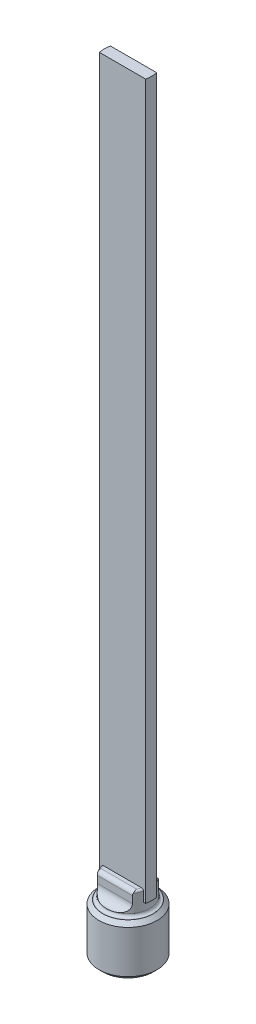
ISO-10303-21;
HEADER;
FILE_DESCRIPTION(('STEP AP214'),'2;1');
FILE_NAME('part.step','',(''),(''),'','','');
FILE_SCHEMA(('AUTOMOTIVE_DESIGN { 1 0 10303 214 1 1 1 1 }'));
ENDSEC;
DATA;
#1=APPLICATION_CONTEXT('core data for automotive mechanical design processes');
#2=APPLICATION_PROTOCOL_DEFINITION('international standard','automotive_design',2000,#1);
#3=PRODUCT_CONTEXT('',#1,'mechanical');
#4=PRODUCT('Part','Part','',(#3));
#5=PRODUCT_RELATED_PRODUCT_CATEGORY('part','',(#4));
#6=PRODUCT_DEFINITION_FORMATION('','',#4);
#7=PRODUCT_DEFINITION_CONTEXT('part definition',#1,'design');
#8=PRODUCT_DEFINITION('design','',#6,#7);
#9=PRODUCT_DEFINITION_SHAPE('','',#8);
#10=(LENGTH_UNIT() NAMED_UNIT(*) SI_UNIT(.MILLI.,.METRE.));
#11=(NAMED_UNIT(*) PLANE_ANGLE_UNIT() SI_UNIT($,.RADIAN.));
#12=(NAMED_UNIT(*) SI_UNIT($,.STERADIAN.) SOLID_ANGLE_UNIT());
#13=UNCERTAINTY_MEASURE_WITH_UNIT(LENGTH_MEASURE(1.E-05),#10,'distance_accuracy_value','');
#14=(GEOMETRIC_REPRESENTATION_CONTEXT(3) GLOBAL_UNCERTAINTY_ASSIGNED_CONTEXT((#13)) GLOBAL_UNIT_ASSIGNED_CONTEXT((#10,
#11,#12)) REPRESENTATION_CONTEXT('',''));
#15=CARTESIAN_POINT('',(0.,0.,0.));
#16=DIRECTION('',(0.,0.,1.));
#17=DIRECTION('',(1.,0.,0.));
#18=AXIS2_PLACEMENT_3D('',#15,#16,#17);
#19=CARTESIAN_POINT('',(0.,9.525,-2.8575));
#20=DIRECTION('',(0.,1.,0.));
#21=DIRECTION('',(0.,0.,1.));
#22=AXIS2_PLACEMENT_3D('',#19,#20,#21);
#23=PLANE('',#22);
#24=DIRECTION('',(1.,0.,0.));
#25=VECTOR('',#24,1.);
#26=CARTESIAN_POINT('',(0.,9.525,0.723899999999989));
#27=LINE('',#26,#25);
#28=CARTESIAN_POINT('',(2.50083606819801,9.525,0.723899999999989));
#29=VERTEX_POINT('',#28);
#30=CARTESIAN_POINT('',(-2.50083606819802,9.525,0.723899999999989));
#31=VERTEX_POINT('',#30);
#32=EDGE_CURVE('E170',#29,#31,#27,.F.);
#33=ORIENTED_EDGE('',*,*,#32,.T.);
#34=CARTESIAN_POINT('',(0.,9.52499999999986,0.));
#35=DIRECTION('',(0.,-1.,0.));
#36=DIRECTION('',(1.,0.,0.));
#37=AXIS2_PLACEMENT_3D('',#34,#35,#36);
#38=CIRCLE('',#37,2.60350000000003);
#39=CARTESIAN_POINT('',(-2.30706956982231,9.52499999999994,1.2065));
#40=VERTEX_POINT('',#39);
#41=EDGE_CURVE('E176',#31,#40,#38,.F.);
#42=ORIENTED_EDGE('',*,*,#41,.T.);
#43=DIRECTION('',(1.,0.,0.));
#44=VECTOR('',#43,1.);
#45=CARTESIAN_POINT('',(0.,9.525,1.2065));
#46=LINE('',#45,#44);
#47=CARTESIAN_POINT('',(2.30706956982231,9.525,1.2065));
#48=VERTEX_POINT('',#47);
#49=EDGE_CURVE('E174',#48,#40,#46,.F.);
#50=ORIENTED_EDGE('',*,*,#49,.F.);
#51=CARTESIAN_POINT('',(0.,9.525,0.));
#52=DIRECTION('',(0.,-1.,0.));
#53=DIRECTION('',(0.,0.,-1.));
#54=AXIS2_PLACEMENT_3D('',#51,#52,#53);
#55=CIRCLE('',#54,2.6035);
#56=EDGE_CURVE('E158',#48,#29,#55,.F.);
#57=ORIENTED_EDGE('',*,*,#56,.T.);
#58=EDGE_LOOP('',(#33,#42,#50,#57));
#59=FACE_BOUND('',#58,.T.);
#60=ADVANCED_FACE('F35',(#59),#23,.T.);
#61=CARTESIAN_POINT('',(0.,9.525,-2.8575));
#62=DIRECTION('',(0.,1.,0.));
#63=DIRECTION('',(0.,0.,1.));
#64=AXIS2_PLACEMENT_3D('',#61,#62,#63);
#65=PLANE('',#64);
#66=DIRECTION('',(1.,0.,0.));
#67=VECTOR('',#66,1.);
#68=CARTESIAN_POINT('',(0.,9.525,-0.7239));
#69=LINE('',#68,#67);
#70=CARTESIAN_POINT('',(-2.50083606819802,9.525,-0.7239));
#71=VERTEX_POINT('',#70);
#72=CARTESIAN_POINT('',(2.50083606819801,9.525,-0.723900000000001));
#73=VERTEX_POINT('',#72);
#74=EDGE_CURVE('E421',#71,#73,#69,.T.);
#75=ORIENTED_EDGE('',*,*,#74,.T.);
#76=CARTESIAN_POINT('',(0.,9.52499999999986,0.));
#77=DIRECTION('',(0.,-1.,0.));
#78=DIRECTION('',(1.,0.,0.));
#79=AXIS2_PLACEMENT_3D('',#76,#77,#78);
#80=CIRCLE('',#79,2.60350000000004);
#81=CARTESIAN_POINT('',(2.30706956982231,9.52499999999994,-1.2065));
#82=VERTEX_POINT('',#81);
#83=EDGE_CURVE('E188',#73,#82,#80,.F.);
#84=ORIENTED_EDGE('',*,*,#83,.T.);
#85=DIRECTION('',(-1.,0.,0.));
#86=VECTOR('',#85,1.);
#87=CARTESIAN_POINT('',(0.,9.525,-1.2065));
#88=LINE('',#87,#86);
#89=CARTESIAN_POINT('',(-2.30706956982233,9.52499999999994,-1.2065));
#90=VERTEX_POINT('',#89);
#91=EDGE_CURVE('E415',#90,#82,#88,.F.);
#92=ORIENTED_EDGE('',*,*,#91,.F.);
#93=CARTESIAN_POINT('',(0.,9.52499999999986,0.));
#94=DIRECTION('',(0.,-1.,0.));
#95=DIRECTION('',(1.,0.,0.));
#96=AXIS2_PLACEMENT_3D('',#93,#94,#95);
#97=CIRCLE('',#96,2.60350000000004);
#98=EDGE_CURVE('E424',#90,#71,#97,.F.);
#99=ORIENTED_EDGE('',*,*,#98,.T.);
#100=EDGE_LOOP('',(#75,#84,#92,#99));
#101=FACE_BOUND('',#100,.T.);
#102=ADVANCED_FACE('F785',(#101),#65,.T.);
#103=CARTESIAN_POINT('',(0.,9.017,1.2065));
#104=DIRECTION('',(1.,0.,0.));
#105=DIRECTION('',(0.,0.,-1.));
#106=AXIS2_PLACEMENT_3D('',#103,#104,#105);
#107=CYLINDRICAL_SURFACE('',#106,0.508);
#108=CARTESIAN_POINT('',(-2.33549536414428,9.27100000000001,1.64644090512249));
#109=CARTESIAN_POINT('',(-2.32711430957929,9.25045802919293,1.65832633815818));
#110=CARTESIAN_POINT('',(-2.31952240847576,9.22876240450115,1.66890508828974));
#111=CARTESIAN_POINT('',(-2.30654707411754,9.18415445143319,1.6867924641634));
#112=CARTESIAN_POINT('',(-2.30111175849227,9.16128790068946,1.69417835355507));
#113=CARTESIAN_POINT('',(-2.29335388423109,9.11846499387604,1.7046613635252));
#114=CARTESIAN_POINT('',(-2.29065110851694,9.09870792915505,1.70828555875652));
#115=CARTESIAN_POINT('',(-2.28694587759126,9.05831449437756,1.71323903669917));
#116=CARTESIAN_POINT('',(-2.28598165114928,9.03766834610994,1.71451673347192));
#117=CARTESIAN_POINT('',(-2.286,9.017,1.7145));
#118=B_SPLINE_CURVE_WITH_KNOTS('',3,(#108,#109,#110,#111,#112,#113,#114,#115,#116,#117),
.UNSPECIFIED.,.F.,.F.,(4,2,2,2,4),(0.,0.0755339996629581,0.149120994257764,0.209711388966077,
0.271618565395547),.UNSPECIFIED.);
#119=CARTESIAN_POINT('',(-2.33549536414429,9.271,1.64644090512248));
#120=VERTEX_POINT('',#119);
#121=CARTESIAN_POINT('',(-2.28600000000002,9.017,1.7145));
#122=VERTEX_POINT('',#121);
#123=EDGE_CURVE('E616',#120,#122,#118,.T.);
#124=ORIENTED_EDGE('',*,*,#123,.T.);
#125=DIRECTION('',(-1.,0.,0.));
#126=VECTOR('',#125,1.);
#127=CARTESIAN_POINT('',(0.,9.017,1.7145));
#128=LINE('',#127,#126);
#129=CARTESIAN_POINT('',(2.28600000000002,9.017,1.7145));
#130=VERTEX_POINT('',#129);
#131=EDGE_CURVE('E410',#122,#130,#128,.F.);
#132=ORIENTED_EDGE('',*,*,#131,.T.);
#133=CARTESIAN_POINT('',(2.286,9.017,1.7145));
#134=CARTESIAN_POINT('',(2.28595922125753,9.04216276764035,1.71453821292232));
#135=CARTESIAN_POINT('',(2.28740065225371,9.06727897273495,1.71263305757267));
#136=CARTESIAN_POINT('',(2.29285493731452,9.11606219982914,1.70533169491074));
#137=CARTESIAN_POINT('',(2.2968018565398,9.13974980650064,1.700024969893));
#138=CARTESIAN_POINT('',(2.30603841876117,9.18172259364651,1.68746527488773));
#139=CARTESIAN_POINT('',(2.31098117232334,9.20023705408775,1.68070290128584));
#140=CARTESIAN_POINT('',(2.3222533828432,9.2364346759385,1.6650948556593));
#141=CARTESIAN_POINT('',(2.32861034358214,9.25409144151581,1.6562075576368));
#142=CARTESIAN_POINT('',(2.33549536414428,9.27100000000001,1.64644090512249));
#143=B_SPLINE_CURVE_WITH_KNOTS('',3,(#133,#134,#135,#136,#137,#138,#139,#140,#141,#142),
.UNSPECIFIED.,.F.,.F.,(4,2,2,2,4),(0.,0.0753042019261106,0.148704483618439,0.209502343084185,
0.271606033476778),.UNSPECIFIED.);
#144=CARTESIAN_POINT('',(2.33549536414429,9.271,1.64644090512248));
#145=VERTEX_POINT('',#144);
#146=EDGE_CURVE('E186',#130,#145,#143,.T.);
#147=ORIENTED_EDGE('',*,*,#146,.T.);
#148=CARTESIAN_POINT('',(2.33549536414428,9.27100000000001,1.64644090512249));
#149=CARTESIAN_POINT('',(2.34271171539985,9.28872841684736,1.6362522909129));
#150=CARTESIAN_POINT('',(2.34846430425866,9.30620849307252,1.6246899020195));
#151=CARTESIAN_POINT('',(2.35733797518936,9.33993546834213,1.59919596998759));
#152=CARTESIAN_POINT('',(2.3604724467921,9.35618825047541,1.5852769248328));
#153=CARTESIAN_POINT('',(2.3644231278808,9.38653250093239,1.55571415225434));
#154=CARTESIAN_POINT('',(2.36529579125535,9.40066812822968,1.54012275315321));
#155=CARTESIAN_POINT('',(2.36522400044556,9.42690473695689,1.5073046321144));
#156=CARTESIAN_POINT('',(2.36427779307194,9.43900374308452,1.49007634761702));
#157=CARTESIAN_POINT('',(2.36070515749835,9.46212399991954,1.45240529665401));
#158=CARTESIAN_POINT('',(2.35790567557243,9.4728811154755,1.4318172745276));
#159=CARTESIAN_POINT('',(2.35088205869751,9.49142830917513,1.38957025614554));
#160=CARTESIAN_POINT('',(2.34665687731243,9.4992161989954,1.36791048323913));
#161=CARTESIAN_POINT('',(2.33713790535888,9.51179318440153,1.3238522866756));
#162=CARTESIAN_POINT('',(2.33183884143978,9.51656698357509,1.30145069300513));
#163=CARTESIAN_POINT('',(2.32054087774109,9.52305190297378,1.2564170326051));
#164=CARTESIAN_POINT('',(2.31454321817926,9.52476836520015,1.23378543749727));
#165=CARTESIAN_POINT('',(2.30793337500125,9.52499271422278,1.20964442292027));
#166=CARTESIAN_POINT('',(2.30750188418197,9.5250000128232,1.20807202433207));
#167=CARTESIAN_POINT('',(2.30706956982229,9.525,1.2065));
#168=B_SPLINE_CURVE_WITH_KNOTS('',3,(#148,#149,#150,#151,#152,#153,#154,#155,#156,#157,#158,
#159,#160,#161,#162,#163,#164,#165,#166,#167),.UNSPECIFIED.,.F.,.F.,(4,2,2,2,2,2,2,2,2,4),(0.,
0.0648980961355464,0.129462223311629,0.192398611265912,0.255395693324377,0.325308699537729,
0.39527313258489,0.46558983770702,0.535783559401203,0.540675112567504),.UNSPECIFIED.);
#169=EDGE_CURVE('E163',#145,#48,#168,.T.);
#170=ORIENTED_EDGE('',*,*,#169,.T.);
#171=ORIENTED_EDGE('',*,*,#49,.T.);
#172=CARTESIAN_POINT('',(-2.30706956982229,9.525,1.2065));
#173=CARTESIAN_POINT('',(-2.30750187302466,9.52500002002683,1.20807198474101));
#174=CARTESIAN_POINT('',(-2.30793336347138,9.5249927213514,1.20964438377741));
#175=CARTESIAN_POINT('',(-2.31614793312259,9.52471377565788,1.2396463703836));
#176=CARTESIAN_POINT('',(-2.32364715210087,9.5220563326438,1.26818878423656));
#177=CARTESIAN_POINT('',(-2.33740246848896,9.51187793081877,1.32477643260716));
#178=CARTESIAN_POINT('',(-2.34365503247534,9.50434339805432,1.35282005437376));
#179=CARTESIAN_POINT('',(-2.35411609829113,9.48453553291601,1.40725680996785));
#180=CARTESIAN_POINT('',(-2.35834617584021,9.4723148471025,1.43366462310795));
#181=CARTESIAN_POINT('',(-2.3640562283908,9.44336954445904,1.48420035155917));
#182=CARTESIAN_POINT('',(-2.36554064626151,9.42665225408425,1.5083318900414));
#183=CARTESIAN_POINT('',(-2.36493592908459,9.39176005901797,1.55039836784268));
#184=CARTESIAN_POINT('',(-2.36328690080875,9.37405831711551,1.5687310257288));
#185=CARTESIAN_POINT('',(-2.35666477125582,9.33645164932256,1.60228630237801));
#186=CARTESIAN_POINT('',(-2.35169444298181,9.31654857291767,1.61751150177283));
#187=CARTESIAN_POINT('',(-2.33890128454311,9.27850848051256,1.64253146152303));
#188=CARTESIAN_POINT('',(-2.33156772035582,9.26050763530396,1.65278595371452));
#189=CARTESIAN_POINT('',(-2.31389025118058,9.22466632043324,1.67054260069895));
#190=CARTESIAN_POINT('',(-2.30355332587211,9.20682557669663,1.67805104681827));
#191=CARTESIAN_POINT('',(-2.28575370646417,9.18084470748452,1.68744522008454));
#192=CARTESIAN_POINT('',(-2.27939659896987,9.17226936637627,1.69027553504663));
#193=CARTESIAN_POINT('',(-2.27266278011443,9.1639114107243,1.69279315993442));
#194=B_SPLINE_CURVE_WITH_KNOTS('',3,(#172,#173,#174,#175,#176,#177,#178,#179,#180,#181,#182,
#183,#184,#185,#186,#187,#188,#189,#190,#191,#192,#193),.UNSPECIFIED.,.F.,.F.,(4,2,2,2,2,2,2,2,
2,2,4),(0.,0.00489155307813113,0.0933121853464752,0.181979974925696,0.269679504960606,
0.357237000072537,0.433394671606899,0.509488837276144,0.575064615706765,0.640489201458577,
0.673568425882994),.UNSPECIFIED.);
#195=EDGE_CURVE('E180',#40,#120,#194,.T.);
#196=ORIENTED_EDGE('',*,*,#195,.T.);
#197=EDGE_LOOP('',(#124,#132,#147,#170,#171,#196));
#198=FACE_BOUND('',#197,.T.);
#199=ADVANCED_FACE('F184',(#198),#107,.T.);
#200=CARTESIAN_POINT('',(0.,9.017,-1.2065));
#201=DIRECTION('',(-1.,0.,0.));
#202=DIRECTION('',(0.,0.,1.));
#203=AXIS2_PLACEMENT_3D('',#200,#201,#202);
#204=CYLINDRICAL_SURFACE('',#203,0.508);
#205=CARTESIAN_POINT('',(2.33549536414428,9.27100000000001,-1.64644090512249));
#206=CARTESIAN_POINT('',(2.32711430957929,9.25045802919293,-1.65832633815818));
#207=CARTESIAN_POINT('',(2.31952240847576,9.22876240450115,-1.66890508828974));
#208=CARTESIAN_POINT('',(2.30654707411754,9.18415445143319,-1.6867924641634));
#209=CARTESIAN_POINT('',(2.30111175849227,9.16128790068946,-1.69417835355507));
#210=CARTESIAN_POINT('',(2.29335388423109,9.11846499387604,-1.7046613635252));
#211=CARTESIAN_POINT('',(2.29065110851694,9.09870792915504,-1.70828555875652));
#212=CARTESIAN_POINT('',(2.28694587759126,9.05831449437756,-1.71323903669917));
#213=CARTESIAN_POINT('',(2.28598165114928,9.03766834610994,-1.71451673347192));
#214=CARTESIAN_POINT('',(2.286,9.017,-1.7145));
#215=B_SPLINE_CURVE_WITH_KNOTS('',3,(#205,#206,#207,#208,#209,#210,#211,#212,#213,#214),
.UNSPECIFIED.,.F.,.F.,(4,2,2,2,4),(0.,0.0755339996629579,0.149120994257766,0.209711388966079,
0.271618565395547),.UNSPECIFIED.);
#216=CARTESIAN_POINT('',(2.33549536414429,9.271,-1.64644090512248));
#217=VERTEX_POINT('',#216);
#218=CARTESIAN_POINT('',(2.28600000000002,9.017,-1.7145));
#219=VERTEX_POINT('',#218);
#220=EDGE_CURVE('E411',#217,#219,#215,.T.);
#221=ORIENTED_EDGE('',*,*,#220,.T.);
#222=DIRECTION('',(1.,0.,0.));
#223=VECTOR('',#222,1.);
#224=CARTESIAN_POINT('',(0.,9.017,-1.7145));
#225=LINE('',#224,#223);
#226=CARTESIAN_POINT('',(-2.28600000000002,9.017,-1.7145));
#227=VERTEX_POINT('',#226);
#228=EDGE_CURVE('E405',#219,#227,#225,.F.);
#229=ORIENTED_EDGE('',*,*,#228,.T.);
#230=CARTESIAN_POINT('',(-2.286,9.017,-1.7145));
#231=CARTESIAN_POINT('',(-2.28595922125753,9.04216276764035,-1.71453821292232));
#232=CARTESIAN_POINT('',(-2.28740065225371,9.06727897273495,-1.71263305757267));
#233=CARTESIAN_POINT('',(-2.29285493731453,9.11606219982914,-1.70533169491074));
#234=CARTESIAN_POINT('',(-2.2968018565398,9.13974980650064,-1.700024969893));
#235=CARTESIAN_POINT('',(-2.30603841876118,9.18172259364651,-1.68746527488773));
#236=CARTESIAN_POINT('',(-2.31098117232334,9.20023705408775,-1.68070290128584));
#237=CARTESIAN_POINT('',(-2.3222533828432,9.2364346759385,-1.6650948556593));
#238=CARTESIAN_POINT('',(-2.32861034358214,9.25409144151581,-1.6562075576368));
#239=CARTESIAN_POINT('',(-2.33549536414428,9.27100000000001,-1.64644090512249));
#240=B_SPLINE_CURVE_WITH_KNOTS('',3,(#230,#231,#232,#233,#234,#235,#236,#237,#238,#239),
.UNSPECIFIED.,.F.,.F.,(4,2,2,2,4),(0.,0.0753042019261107,0.148704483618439,0.209502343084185,
0.27160603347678),.UNSPECIFIED.);
#241=CARTESIAN_POINT('',(-2.33549536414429,9.27100000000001,-1.64644090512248));
#242=VERTEX_POINT('',#241);
#243=EDGE_CURVE('E610',#227,#242,#240,.T.);
#244=ORIENTED_EDGE('',*,*,#243,.T.);
#245=CARTESIAN_POINT('',(-2.33549536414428,9.27100000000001,-1.64644090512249));
#246=CARTESIAN_POINT('',(-2.34271171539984,9.28872841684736,-1.6362522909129));
#247=CARTESIAN_POINT('',(-2.34846430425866,9.30620849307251,-1.62468990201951));
#248=CARTESIAN_POINT('',(-2.35733797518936,9.33993546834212,-1.5991959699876));
#249=CARTESIAN_POINT('',(-2.3604724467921,9.3561882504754,-1.5852769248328));
#250=CARTESIAN_POINT('',(-2.3644231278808,9.38653250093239,-1.55571415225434));
#251=CARTESIAN_POINT('',(-2.36529579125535,9.40066812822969,-1.5401227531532));
#252=CARTESIAN_POINT('',(-2.36522400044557,9.4269047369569,-1.50730463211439));
#253=CARTESIAN_POINT('',(-2.36427779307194,9.43900374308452,-1.49007634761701));
#254=CARTESIAN_POINT('',(-2.36070515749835,9.46212399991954,-1.45240529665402));
#255=CARTESIAN_POINT('',(-2.35790567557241,9.47288111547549,-1.43181727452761));
#256=CARTESIAN_POINT('',(-2.35088205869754,9.49142830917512,-1.38957025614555));
#257=CARTESIAN_POINT('',(-2.34665687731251,9.4992161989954,-1.36791048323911));
#258=CARTESIAN_POINT('',(-2.33713790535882,9.51179318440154,-1.3238522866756));
#259=CARTESIAN_POINT('',(-2.33183884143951,9.51656698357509,-1.30145069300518));
#260=CARTESIAN_POINT('',(-2.32054087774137,9.52305190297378,-1.256417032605));
#261=CARTESIAN_POINT('',(-2.3145432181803,9.52476836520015,-1.23378543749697));
#262=CARTESIAN_POINT('',(-2.3079333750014,9.52499271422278,-1.20964442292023));
#263=CARTESIAN_POINT('',(-2.30750188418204,9.52500001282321,-1.20807202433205));
#264=CARTESIAN_POINT('',(-2.30706956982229,9.525,-1.2065));
#265=B_SPLINE_CURVE_WITH_KNOTS('',3,(#245,#246,#247,#248,#249,#250,#251,#252,#253,#254,#255,
#256,#257,#258,#259,#260,#261,#262,#263,#264),.UNSPECIFIED.,.F.,.F.,(4,2,2,2,2,2,2,2,2,4),(0.,
0.0648980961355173,0.12946222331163,0.192398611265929,0.255395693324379,0.325308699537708,
0.395273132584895,0.465589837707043,0.535783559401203,0.540675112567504),.UNSPECIFIED.);
#266=EDGE_CURVE('E419',#242,#90,#265,.T.);
#267=ORIENTED_EDGE('',*,*,#266,.T.);
#268=ORIENTED_EDGE('',*,*,#91,.T.);
#269=CARTESIAN_POINT('',(2.30706956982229,9.525,-1.2065));
#270=CARTESIAN_POINT('',(2.30750187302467,9.52500002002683,-1.20807198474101));
#271=CARTESIAN_POINT('',(2.30793336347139,9.5249927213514,-1.2096443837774));
#272=CARTESIAN_POINT('',(2.31614793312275,9.52471377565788,-1.23964637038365));
#273=CARTESIAN_POINT('',(2.32364715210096,9.52205633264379,-1.26818878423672));
#274=CARTESIAN_POINT('',(2.337402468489,9.51187793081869,-1.32477643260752));
#275=CARTESIAN_POINT('',(2.34365503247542,9.5043433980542,-1.3528200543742));
#276=CARTESIAN_POINT('',(2.35411609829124,9.48453553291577,-1.40725680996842));
#277=CARTESIAN_POINT('',(2.35834617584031,9.4723148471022,-1.43366462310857));
#278=CARTESIAN_POINT('',(2.36405622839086,9.44336954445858,-1.48420035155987));
#279=CARTESIAN_POINT('',(2.36554064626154,9.42665225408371,-1.50833189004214));
#280=CARTESIAN_POINT('',(2.36493592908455,9.39176005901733,-1.55039836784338));
#281=CARTESIAN_POINT('',(2.36328690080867,9.37405831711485,-1.56873102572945));
#282=CARTESIAN_POINT('',(2.35666477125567,9.33645164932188,-1.60228630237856));
#283=CARTESIAN_POINT('',(2.35169444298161,9.31654857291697,-1.61751150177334));
#284=CARTESIAN_POINT('',(2.33890128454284,9.27850848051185,-1.64253146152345));
#285=CARTESIAN_POINT('',(2.33156772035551,9.26050763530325,-1.65278595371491));
#286=CARTESIAN_POINT('',(2.3138902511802,9.22466632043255,-1.67054260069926));
#287=CARTESIAN_POINT('',(2.30355332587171,9.20682557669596,-1.67805104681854));
#288=CARTESIAN_POINT('',(2.28575370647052,9.18084470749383,-1.68744522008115));
#289=CARTESIAN_POINT('',(2.27939659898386,9.17226936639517,-1.69027553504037));
#290=CARTESIAN_POINT('',(2.27266278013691,9.16391141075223,-1.69279315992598));
#291=B_SPLINE_CURVE_WITH_KNOTS('',3,(#269,#270,#271,#272,#273,#274,#275,#276,#277,#278,#279,
#280,#281,#282,#283,#284,#285,#286,#287,#288,#289,#290),.UNSPECIFIED.,.F.,.F.,(4,2,2,2,2,2,2,2,
2,2,4),(0.,0.00489155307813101,0.0933121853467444,0.181979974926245,0.269679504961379,
0.357237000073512,0.433394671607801,0.509488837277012,0.575064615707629,0.640489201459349,
0.673568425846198),.UNSPECIFIED.);
#292=EDGE_CURVE('E418',#82,#217,#291,.T.);
#293=ORIENTED_EDGE('',*,*,#292,.T.);
#294=EDGE_LOOP('',(#221,#229,#244,#267,#268,#293));
#295=FACE_BOUND('',#294,.T.);
#296=ADVANCED_FACE('F595',(#295),#204,.T.);
#297=CARTESIAN_POINT('',(0.,6.985,1.7145));
#298=DIRECTION('',(0.,0.,-1.));
#299=DIRECTION('',(-1.,0.,0.));
#300=AXIS2_PLACEMENT_3D('',#297,#298,#299);
#301=PLANE('',#300);
#302=ORIENTED_EDGE('',*,*,#131,.F.);
#303=DIRECTION('',(0.,1.,0.));
#304=VECTOR('',#303,1.);
#305=CARTESIAN_POINT('',(-2.28600000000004,6.985,1.7145));
#306=LINE('',#305,#304);
#307=CARTESIAN_POINT('',(-2.28600000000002,8.1026,1.7145));
#308=VERTEX_POINT('',#307);
#309=EDGE_CURVE('E408',#308,#122,#306,.T.);
#310=ORIENTED_EDGE('',*,*,#309,.F.);
#311=DIRECTION('',(1.,0.,0.));
#312=VECTOR('',#311,1.);
#313=CARTESIAN_POINT('',(0.,8.1026,1.7145));
#314=LINE('',#313,#312);
#315=CARTESIAN_POINT('',(2.28600000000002,8.1026,1.7145));
#316=VERTEX_POINT('',#315);
#317=EDGE_CURVE('E374',#308,#316,#314,.T.);
#318=ORIENTED_EDGE('',*,*,#317,.T.);
#319=DIRECTION('',(0.,1.,0.));
#320=VECTOR('',#319,1.);
#321=CARTESIAN_POINT('',(2.28600000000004,6.985,1.7145));
#322=LINE('',#321,#320);
#323=EDGE_CURVE('E406',#130,#316,#322,.F.);
#324=ORIENTED_EDGE('',*,*,#323,.F.);
#325=EDGE_LOOP('',(#302,#310,#318,#324));
#326=FACE_BOUND('',#325,.T.);
#327=ADVANCED_FACE('F599',(#326),#301,.F.);
#328=CARTESIAN_POINT('',(0.,9.525,-1.7145));
#329=DIRECTION('',(0.,0.,1.));
#330=DIRECTION('',(1.,0.,0.));
#331=AXIS2_PLACEMENT_3D('',#328,#329,#330);
#332=PLANE('',#331);
#333=ORIENTED_EDGE('',*,*,#228,.F.);
#334=DIRECTION('',(0.,1.,0.));
#335=VECTOR('',#334,1.);
#336=CARTESIAN_POINT('',(2.28600000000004,9.525,-1.7145));
#337=LINE('',#336,#335);
#338=CARTESIAN_POINT('',(2.28600000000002,8.1026,-1.7145));
#339=VERTEX_POINT('',#338);
#340=EDGE_CURVE('E403',#339,#219,#337,.T.);
#341=ORIENTED_EDGE('',*,*,#340,.F.);
#342=DIRECTION('',(1.,0.,0.));
#343=VECTOR('',#342,1.);
#344=CARTESIAN_POINT('',(0.,8.1026,-1.7145));
#345=LINE('',#344,#343);
#346=CARTESIAN_POINT('',(-2.28600000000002,8.1026,-1.7145));
#347=VERTEX_POINT('',#346);
#348=EDGE_CURVE('E367',#339,#347,#345,.F.);
#349=ORIENTED_EDGE('',*,*,#348,.T.);
#350=DIRECTION('',(0.,1.,0.));
#351=VECTOR('',#350,1.);
#352=CARTESIAN_POINT('',(-2.28600000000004,9.525,-1.7145));
#353=LINE('',#352,#351);
#354=EDGE_CURVE('E377',#227,#347,#353,.F.);
#355=ORIENTED_EDGE('',*,*,#354,.F.);
#356=EDGE_LOOP('',(#333,#341,#349,#355));
#357=FACE_BOUND('',#356,.T.);
#358=ADVANCED_FACE('F251',(#357),#332,.F.);
#359=CARTESIAN_POINT('',(0.,5.4102,0.));
#360=DIRECTION('',(0.,-1.,0.));
#361=DIRECTION('',(0.,0.,-1.));
#362=AXIS2_PLACEMENT_3D('',#359,#360,#361);
#363=PLANE('',#362);
#364=DIRECTION('',(0.866025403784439,0.,0.5));
#365=VECTOR('',#364,1.);
#366=CARTESIAN_POINT('',(-1.9812,5.4102,1.14384635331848));
#367=LINE('',#366,#365);
#368=CARTESIAN_POINT('',(0.,5.4102,2.28769270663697));
#369=VERTEX_POINT('',#368);
#370=CARTESIAN_POINT('',(-1.9812,5.4102,1.14384635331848));
#371=VERTEX_POINT('',#370);
#372=EDGE_CURVE('E353',#369,#371,#367,.F.);
#373=ORIENTED_EDGE('',*,*,#372,.T.);
#374=DIRECTION('',(0.,0.,1.));
#375=VECTOR('',#374,1.);
#376=CARTESIAN_POINT('',(-1.9812,5.4102,-1.14384635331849));
#377=LINE('',#376,#375);
#378=CARTESIAN_POINT('',(-1.9812,5.4102,-1.14384635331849));
#379=VERTEX_POINT('',#378);
#380=EDGE_CURVE('E360',#371,#379,#377,.F.);
#381=ORIENTED_EDGE('',*,*,#380,.T.);
#382=DIRECTION('',(-0.866025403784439,0.,0.5));
#383=VECTOR('',#382,1.);
#384=CARTESIAN_POINT('',(0.,5.4102,-2.28769270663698));
#385=LINE('',#384,#383);
#386=CARTESIAN_POINT('',(0.,5.4102,-2.28769270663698));
#387=VERTEX_POINT('',#386);
#388=EDGE_CURVE('E363',#379,#387,#385,.F.);
#389=ORIENTED_EDGE('',*,*,#388,.T.);
#390=DIRECTION('',(-0.866025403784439,0.,-0.5));
#391=VECTOR('',#390,1.);
#392=CARTESIAN_POINT('',(1.9812,5.4102,-1.14384635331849));
#393=LINE('',#392,#391);
#394=CARTESIAN_POINT('',(1.9812,5.4102,-1.14384635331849));
#395=VERTEX_POINT('',#394);
#396=EDGE_CURVE('E380',#387,#395,#393,.F.);
#397=ORIENTED_EDGE('',*,*,#396,.T.);
#398=DIRECTION('',(0.,0.,-1.));
#399=VECTOR('',#398,1.);
#400=CARTESIAN_POINT('',(1.9812,5.4102,1.14384635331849));
#401=LINE('',#400,#399);
#402=CARTESIAN_POINT('',(1.9812,5.4102,1.14384635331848));
#403=VERTEX_POINT('',#402);
#404=EDGE_CURVE('E339',#395,#403,#401,.F.);
#405=ORIENTED_EDGE('',*,*,#404,.T.);
#406=DIRECTION('',(0.866025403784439,0.,-0.5));
#407=VECTOR('',#406,1.);
#408=CARTESIAN_POINT('',(0.,5.4102,2.28769270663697));
#409=LINE('',#408,#407);
#410=EDGE_CURVE('E346',#403,#369,#409,.F.);
#411=ORIENTED_EDGE('',*,*,#410,.T.);
#412=EDGE_LOOP('',(#373,#381,#389,#397,#405,#411));
#413=FACE_BOUND('',#412,.T.);
#414=ADVANCED_FACE('F243',(#413),#363,.T.);
#415=CARTESIAN_POINT('',(0.,9.27099999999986,0.));
#416=DIRECTION('',(0.,-1.,0.));
#417=DIRECTION('',(1.,0.,0.));
#418=AXIS2_PLACEMENT_3D('',#415,#416,#417);
#419=TOROIDAL_SURFACE('',#418,2.60349999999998,0.254000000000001);
#420=CARTESIAN_POINT('',(-2.50083606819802,9.525,0.723899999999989));
#421=CARTESIAN_POINT('',(-2.51609312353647,9.52501058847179,0.723899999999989));
#422=CARTESIAN_POINT('',(-2.5313516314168,9.52373209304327,0.723899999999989));
#423=CARTESIAN_POINT('',(-2.56145245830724,9.51865817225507,0.723899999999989));
#424=CARTESIAN_POINT('',(-2.57629454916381,9.51486139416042,0.723899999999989));
#425=CARTESIAN_POINT('',(-2.60514106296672,9.50480706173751,0.723899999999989));
#426=CARTESIAN_POINT('',(-2.61914460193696,9.49854696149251,0.723899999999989));
#427=CARTESIAN_POINT('',(-2.64586196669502,9.48371604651,0.723899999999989));
#428=CARTESIAN_POINT('',(-2.65857654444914,9.47514658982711,0.723899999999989));
#429=CARTESIAN_POINT('',(-2.68204857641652,9.45612693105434,0.723899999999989));
#430=CARTESIAN_POINT('',(-2.6928430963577,9.44572251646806,0.723899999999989));
#431=CARTESIAN_POINT('',(-2.71245697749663,9.42318671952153,0.723899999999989));
#432=CARTESIAN_POINT('',(-2.72127609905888,9.41105512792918,0.723899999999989));
#433=CARTESIAN_POINT('',(-2.73635645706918,9.3858730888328,0.723899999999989));
#434=CARTESIAN_POINT('',(-2.74269653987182,9.3728697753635,0.723899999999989));
#435=CARTESIAN_POINT('',(-2.75302461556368,9.3459671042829,0.723899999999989));
#436=CARTESIAN_POINT('',(-2.75701517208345,9.33206874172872,0.723899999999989));
#437=CARTESIAN_POINT('',(-2.76126680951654,9.3102065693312,0.723899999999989));
#438=CARTESIAN_POINT('',(-2.76239837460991,9.3024024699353,0.723899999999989));
#439=CARTESIAN_POINT('',(-2.76390741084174,9.28673354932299,0.723899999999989));
#440=CARTESIAN_POINT('',(-2.7642860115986,9.27886883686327,0.723899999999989));
#441=CARTESIAN_POINT('',(-2.76428562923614,9.27100000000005,0.723899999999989));
#442=B_SPLINE_CURVE_WITH_KNOTS('',3,(#420,#421,#422,#423,#424,#425,#426,#427,#428,#429,#430,
#431,#432,#433,#434,#435,#436,#437,#438,#439,#440,#441),.UNSPECIFIED.,.F.,.F.,(4,2,2,2,2,2,2,2,
2,2,4),(0.,0.0457204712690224,0.0914655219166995,0.137257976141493,0.183023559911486,
0.227776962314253,0.272535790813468,0.315725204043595,0.358867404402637,0.382492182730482,
0.40608149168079),.UNSPECIFIED.);
#443=CARTESIAN_POINT('',(-2.76428562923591,9.27100000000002,0.723899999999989));
#444=VERTEX_POINT('',#443);
#445=EDGE_CURVE('E228',#31,#444,#442,.T.);
#446=ORIENTED_EDGE('',*,*,#445,.T.);
#447=CARTESIAN_POINT('',(0.,9.271,0.));
#448=DIRECTION('',(0.,-1.,0.));
#449=DIRECTION('',(0.,0.,-1.));
#450=AXIS2_PLACEMENT_3D('',#447,#448,#449);
#451=CIRCLE('',#450,2.8575);
#452=EDGE_CURVE('E323',#120,#444,#451,.T.);
#453=ORIENTED_EDGE('',*,*,#452,.F.);
#454=ORIENTED_EDGE('',*,*,#195,.F.);
#455=ORIENTED_EDGE('',*,*,#41,.F.);
#456=EDGE_LOOP('',(#446,#453,#454,#455));
#457=FACE_BOUND('',#456,.T.);
#458=ADVANCED_FACE('F239',(#457),#419,.T.);
#459=CARTESIAN_POINT('',(0.,9.27099999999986,0.));
#460=DIRECTION('',(0.,-1.,0.));
#461=DIRECTION('',(1.,0.,0.));
#462=AXIS2_PLACEMENT_3D('',#459,#460,#461);
#463=TOROIDAL_SURFACE('',#462,2.60349999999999,0.253999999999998);
#464=CARTESIAN_POINT('',(-2.76428562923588,9.271,-0.7239));
#465=CARTESIAN_POINT('',(-2.76429951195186,9.28494381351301,-0.7239));
#466=CARTESIAN_POINT('',(-2.76309961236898,9.29888149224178,-0.7239));
#467=CARTESIAN_POINT('',(-2.75837767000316,9.32633505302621,-0.7239));
#468=CARTESIAN_POINT('',(-2.75485946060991,9.33985159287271,-0.7239));
#469=CARTESIAN_POINT('',(-2.74560482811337,9.36610434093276,-0.7239));
#470=CARTESIAN_POINT('',(-2.73986799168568,9.37884040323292,-0.7239));
#471=CARTESIAN_POINT('',(-2.7263656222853,9.40318597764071,-0.7239));
#472=CARTESIAN_POINT('',(-2.71859995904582,9.41479541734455,-0.7239));
#473=CARTESIAN_POINT('',(-2.70116404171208,9.43673366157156,-0.7239));
#474=CARTESIAN_POINT('',(-2.69147001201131,9.44704354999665,-0.7239));
#475=CARTESIAN_POINT('',(-2.67053428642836,9.46595014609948,-0.7239));
#476=CARTESIAN_POINT('',(-2.65929225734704,9.47454648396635,-0.7239));
#477=CARTESIAN_POINT('',(-2.63520948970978,9.49006948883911,-0.7239));
#478=CARTESIAN_POINT('',(-2.62232979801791,9.49693565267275,-0.7239));
#479=CARTESIAN_POINT('',(-2.59562749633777,9.50848901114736,-0.7239));
#480=CARTESIAN_POINT('',(-2.58180491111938,9.51317626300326,-0.7239));
#481=CARTESIAN_POINT('',(-2.55677523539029,9.51947996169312,-0.7239));
#482=CARTESIAN_POINT('',(-2.54567975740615,9.52155013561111,-0.7239));
#483=CARTESIAN_POINT('',(-2.52333560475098,9.52431016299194,-0.7239));
#484=CARTESIAN_POINT('',(-2.51208719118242,9.52500212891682,-0.7239));
#485=CARTESIAN_POINT('',(-2.50083606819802,9.525,-0.7239));
#486=B_SPLINE_CURVE_WITH_KNOTS('',3,(#464,#465,#466,#467,#468,#469,#470,#471,#472,#473,#474,
#475,#476,#477,#478,#479,#480,#481,#482,#483,#484,#485),.UNSPECIFIED.,.F.,.F.,(4,2,2,2,2,2,2,2,
2,2,4),(0.,0.0417706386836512,0.0834723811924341,0.125181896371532,0.166894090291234,
0.209156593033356,0.251428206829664,0.295019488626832,0.33860962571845,0.37238798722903,
0.406114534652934),.UNSPECIFIED.);
#487=CARTESIAN_POINT('',(-2.76428562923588,9.271,-0.723900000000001));
#488=VERTEX_POINT('',#487);
#489=EDGE_CURVE('E432',#488,#71,#486,.T.);
#490=ORIENTED_EDGE('',*,*,#489,.T.);
#491=ORIENTED_EDGE('',*,*,#98,.F.);
#492=ORIENTED_EDGE('',*,*,#266,.F.);
#493=CARTESIAN_POINT('',(0.,9.271,0.));
#494=DIRECTION('',(0.,-1.,0.));
#495=DIRECTION('',(0.,0.,-1.));
#496=AXIS2_PLACEMENT_3D('',#493,#494,#495);
#497=CIRCLE('',#496,2.8575);
#498=EDGE_CURVE('E319',#488,#242,#497,.T.);
#499=ORIENTED_EDGE('',*,*,#498,.F.);
#500=EDGE_LOOP('',(#490,#491,#492,#499));
#501=FACE_BOUND('',#500,.T.);
#502=ADVANCED_FACE('F216',(#501),#463,.T.);
#503=CARTESIAN_POINT('',(0.,9.271,0.));
#504=DIRECTION('',(0.,-1.,0.));
#505=DIRECTION('',(0.,0.,-1.));
#506=AXIS2_PLACEMENT_3D('',#503,#504,#505);
#507=TOROIDAL_SURFACE('',#506,2.6035,0.253999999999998);
#508=CARTESIAN_POINT('',(2.76428562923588,9.271,0.723899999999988));
#509=CARTESIAN_POINT('',(2.76429951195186,9.28494381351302,0.723899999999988));
#510=CARTESIAN_POINT('',(2.76309961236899,9.29888149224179,0.723899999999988));
#511=CARTESIAN_POINT('',(2.75837767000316,9.32633505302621,0.723899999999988));
#512=CARTESIAN_POINT('',(2.75485946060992,9.33985159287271,0.723899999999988));
#513=CARTESIAN_POINT('',(2.74560482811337,9.36610434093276,0.723899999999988));
#514=CARTESIAN_POINT('',(2.73986799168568,9.37884040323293,0.723899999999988));
#515=CARTESIAN_POINT('',(2.7263656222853,9.40318597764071,0.723899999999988));
#516=CARTESIAN_POINT('',(2.71859995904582,9.41479541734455,0.723899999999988));
#517=CARTESIAN_POINT('',(2.70116404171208,9.43673366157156,0.723899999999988));
#518=CARTESIAN_POINT('',(2.69147001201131,9.44704354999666,0.723899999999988));
#519=CARTESIAN_POINT('',(2.67053428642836,9.46595014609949,0.723899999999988));
#520=CARTESIAN_POINT('',(2.65929225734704,9.47454648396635,0.723899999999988));
#521=CARTESIAN_POINT('',(2.63520948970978,9.49006948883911,0.723899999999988));
#522=CARTESIAN_POINT('',(2.62232979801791,9.49693565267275,0.723899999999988));
#523=CARTESIAN_POINT('',(2.59562749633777,9.50848901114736,0.723899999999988));
#524=CARTESIAN_POINT('',(2.58180491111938,9.51317626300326,0.723899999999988));
#525=CARTESIAN_POINT('',(2.55677523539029,9.51947996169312,0.723899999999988));
#526=CARTESIAN_POINT('',(2.54567975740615,9.52155013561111,0.723899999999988));
#527=CARTESIAN_POINT('',(2.52333560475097,9.52431016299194,0.723899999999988));
#528=CARTESIAN_POINT('',(2.51208719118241,9.52500212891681,0.723899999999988));
#529=CARTESIAN_POINT('',(2.50083606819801,9.525,0.723899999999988));
#530=B_SPLINE_CURVE_WITH_KNOTS('',3,(#508,#509,#510,#511,#512,#513,#514,#515,#516,#517,#518,
#519,#520,#521,#522,#523,#524,#525,#526,#527,#528,#529),.UNSPECIFIED.,.F.,.F.,(4,2,2,2,2,2,2,2,
2,2,4),(0.,0.041770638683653,0.0834723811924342,0.125181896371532,0.166894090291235,
0.209156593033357,0.251428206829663,0.295019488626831,0.338609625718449,0.372387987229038,
0.406114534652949),.UNSPECIFIED.);
#531=CARTESIAN_POINT('',(2.76428562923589,9.271,0.723899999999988));
#532=VERTEX_POINT('',#531);
#533=EDGE_CURVE('E167',#532,#29,#530,.T.);
#534=ORIENTED_EDGE('',*,*,#533,.T.);
#535=ORIENTED_EDGE('',*,*,#56,.F.);
#536=ORIENTED_EDGE('',*,*,#169,.F.);
#537=CARTESIAN_POINT('',(0.,9.271,0.));
#538=DIRECTION('',(0.,-1.,0.));
#539=DIRECTION('',(0.,0.,-1.));
#540=AXIS2_PLACEMENT_3D('',#537,#538,#539);
#541=CIRCLE('',#540,2.8575);
#542=EDGE_CURVE('E312',#532,#145,#541,.T.);
#543=ORIENTED_EDGE('',*,*,#542,.F.);
#544=EDGE_LOOP('',(#534,#535,#536,#543));
#545=FACE_BOUND('',#544,.T.);
#546=ADVANCED_FACE('F160',(#545),#507,.T.);
#547=CARTESIAN_POINT('',(0.,8.1026,2.8321));
#548=DIRECTION('',(1.,0.,0.));
#549=DIRECTION('',(0.,0.,-1.));
#550=AXIS2_PLACEMENT_3D('',#547,#548,#549);
#551=CYLINDRICAL_SURFACE('',#550,1.1176);
#552=CARTESIAN_POINT('',(2.286,8.1026,1.7145));
#553=CARTESIAN_POINT('',(2.28599868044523,8.07660409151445,1.71449808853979));
#554=CARTESIAN_POINT('',(2.28531941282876,8.05062141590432,1.7154078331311));
#555=CARTESIAN_POINT('',(2.28260235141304,7.99885800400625,1.71902308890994));
#556=CARTESIAN_POINT('',(2.28056483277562,7.97307722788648,1.72172823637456));
#557=CARTESIAN_POINT('',(2.27243357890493,7.89650193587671,1.73246562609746));
#558=CARTESIAN_POINT('',(2.26432113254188,7.84625133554,1.74312032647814));
#559=CARTESIAN_POINT('',(2.24275895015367,7.74878062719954,1.77077411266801));
#560=CARTESIAN_POINT('',(2.22930990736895,7.70156012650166,1.78777237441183));
#561=CARTESIAN_POINT('',(2.19720687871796,7.611281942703,1.82708227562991));
#562=CARTESIAN_POINT('',(2.1785513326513,7.56822551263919,1.84939550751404));
#563=CARTESIAN_POINT('',(2.1357233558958,7.48602509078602,1.89870526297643));
#564=CARTESIAN_POINT('',(2.11141471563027,7.44701930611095,1.92581262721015));
#565=CARTESIAN_POINT('',(2.05801853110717,7.37472790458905,1.98277425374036));
#566=CARTESIAN_POINT('',(2.02892868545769,7.3414450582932,2.0126298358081));
#567=CARTESIAN_POINT('',(1.95390397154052,7.26834518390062,2.08597532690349));
#568=CARTESIAN_POINT('',(1.90590351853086,7.2312957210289,2.13011341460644));
#569=CARTESIAN_POINT('',(1.80310441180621,7.16737464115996,2.21781542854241));
#570=CARTESIAN_POINT('',(1.74829472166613,7.14051984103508,2.26137829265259));
#571=CARTESIAN_POINT('',(1.64963880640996,7.10164774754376,2.33380048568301));
#572=CARTESIAN_POINT('',(1.60706394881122,7.087581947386,2.36333975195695));
#573=CARTESIAN_POINT('',(1.51962443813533,7.06309365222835,2.42049184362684));
#574=CARTESIAN_POINT('',(1.47475874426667,7.0526728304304,2.44810377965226));
#575=CARTESIAN_POINT('',(1.33695914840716,7.02579476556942,2.52766434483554));
#576=CARTESIAN_POINT('',(1.24109966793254,7.01382009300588,2.57613266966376));
#577=CARTESIAN_POINT('',(1.08181395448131,7.00033647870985,2.64564274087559));
#578=CARTESIAN_POINT('',(1.01997669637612,6.99657733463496,2.67009103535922));
#579=CARTESIAN_POINT('',(0.894634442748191,6.99096072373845,2.71465493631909));
#580=CARTESIAN_POINT('',(0.831128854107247,6.98910394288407,2.73476897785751));
#581=CARTESIAN_POINT('',(0.703521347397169,6.98656590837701,2.77032631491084));
#582=CARTESIAN_POINT('',(0.639432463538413,6.98587265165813,2.78581592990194));
#583=CARTESIAN_POINT('',(0.510380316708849,6.98510378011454,2.81232265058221));
#584=CARTESIAN_POINT('',(0.445417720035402,6.98502771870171,2.82334298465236));
#585=CARTESIAN_POINT('',(0.380152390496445,6.985,2.83209999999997));
#586=B_SPLINE_CURVE_WITH_KNOTS('',3,(#552,#553,#554,#555,#556,#557,#558,#559,#560,#561,#562,
#563,#564,#565,#566,#567,#568,#569,#570,#571,#572,#573,#574,#575,#576,#577,#578,#579,#580,#581,
#582,#583,#584,#585),.UNSPECIFIED.,.F.,.F.,(4,2,2,2,2,2,2,2,2,2,2,2,2,2,2,2,4),(0.,
0.0779369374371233,0.155858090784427,0.311040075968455,0.466201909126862,0.621410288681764,
0.780838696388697,0.94034406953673,1.16409398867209,1.38821141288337,1.54907855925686,
1.71001945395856,2.03296347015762,2.23261987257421,2.43234824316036,2.63000323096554,
2.82751518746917),.UNSPECIFIED.);
#587=CARTESIAN_POINT('',(0.380152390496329,6.985,2.83209999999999));
#588=VERTEX_POINT('',#587);
#589=EDGE_CURVE('E314',#316,#588,#586,.T.);
#590=ORIENTED_EDGE('',*,*,#589,.F.);
#591=ORIENTED_EDGE('',*,*,#317,.F.);
#592=CARTESIAN_POINT('',(-0.380152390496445,6.985,2.83209999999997));
#593=CARTESIAN_POINT('',(-0.418967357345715,6.98500266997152,2.82688984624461));
#594=CARTESIAN_POINT('',(-0.45767080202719,6.9850361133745,2.82088225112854));
#595=CARTESIAN_POINT('',(-0.534799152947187,6.98525439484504,2.80728160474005));
#596=CARTESIAN_POINT('',(-0.573224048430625,6.98543923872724,2.79968849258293));
#597=CARTESIAN_POINT('',(-0.688117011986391,6.98635664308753,2.77451859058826));
#598=CARTESIAN_POINT('',(-0.764077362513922,6.98745265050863,2.75456815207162));
#599=CARTESIAN_POINT('',(-0.914906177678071,6.99163881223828,2.70823699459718));
#600=CARTESIAN_POINT('',(-0.989752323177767,6.99475155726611,2.6817855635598));
#601=CARTESIAN_POINT('',(-1.13673717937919,7.00435691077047,2.62286026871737));
#602=CARTESIAN_POINT('',(-1.20887866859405,7.01084594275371,2.59039280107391));
#603=CARTESIAN_POINT('',(-1.36173954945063,7.03042004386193,2.51385278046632));
#604=CARTESIAN_POINT('',(-1.44183398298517,7.04443844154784,2.46874573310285));
#605=CARTESIAN_POINT('',(-1.59535526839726,7.08261253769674,2.37240154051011));
#606=CARTESIAN_POINT('',(-1.66881004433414,7.10672312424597,2.32119239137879));
#607=CARTESIAN_POINT('',(-1.7911093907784,7.16147986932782,2.22749680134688));
#608=CARTESIAN_POINT('',(-1.8417255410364,7.18934162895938,2.18571795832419));
#609=CARTESIAN_POINT('',(-1.93650283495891,7.25462052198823,2.10219707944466));
#610=CARTESIAN_POINT('',(-1.98066962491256,7.29202921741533,2.06045504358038));
#611=CARTESIAN_POINT('',(-2.05370812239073,7.36925903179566,1.98739934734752));
#612=CARTESIAN_POINT('',(-2.08389781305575,7.407353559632,1.95558505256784));
#613=CARTESIAN_POINT('',(-2.13842050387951,7.49022968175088,1.8958111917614));
#614=CARTESIAN_POINT('',(-2.16275511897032,7.53500942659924,1.86785056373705));
#615=CARTESIAN_POINT('',(-2.20520009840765,7.63072917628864,1.8175520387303));
#616=CARTESIAN_POINT('',(-2.22327322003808,7.68170368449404,1.79524798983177));
#617=CARTESIAN_POINT('',(-2.25270472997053,7.78813372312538,1.75817942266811));
#618=CARTESIAN_POINT('',(-2.26406991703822,7.84358465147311,1.74340727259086));
#619=CARTESIAN_POINT('',(-2.27668887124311,7.93342266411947,1.72686169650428));
#620=CARTESIAN_POINT('',(-2.28018131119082,7.9670084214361,1.72223814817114));
#621=CARTESIAN_POINT('',(-2.28483466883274,8.03458887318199,1.71605417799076));
#622=CARTESIAN_POINT('',(-2.28599772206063,8.06858316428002,1.71449095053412));
#623=CARTESIAN_POINT('',(-2.286,8.1026,1.7145));
#624=B_SPLINE_CURVE_WITH_KNOTS('',3,(#592,#593,#594,#595,#596,#597,#598,#599,#600,#601,#602,
#603,#604,#605,#606,#607,#608,#609,#610,#611,#612,#613,#614,#615,#616,#617,#618,#619,#620,#621,
#622,#623),.UNSPECIFIED.,.F.,.F.,(4,2,2,2,2,2,2,2,2,2,2,2,2,2,2,4),(0.,0.117471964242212,
0.234948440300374,0.470281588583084,0.708297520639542,0.946061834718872,1.22422091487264,
1.50114968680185,1.71429427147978,1.92725111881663,2.10081120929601,2.27432337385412,
2.44885053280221,2.62320049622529,2.7252456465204,2.82719720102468),.UNSPECIFIED.);
#625=CARTESIAN_POINT('',(-0.380152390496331,6.985,2.83209999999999));
#626=VERTEX_POINT('',#625);
#627=EDGE_CURVE('E315',#626,#308,#624,.T.);
#628=ORIENTED_EDGE('',*,*,#627,.F.);
#629=DIRECTION('',(1.,0.,0.));
#630=VECTOR('',#629,1.);
#631=CARTESIAN_POINT('',(0.,6.985,2.8321));
#632=LINE('',#631,#630);
#633=EDGE_CURVE('E371',#588,#626,#632,.F.);
#634=ORIENTED_EDGE('',*,*,#633,.F.);
#635=EDGE_LOOP('',(#590,#591,#628,#634));
#636=FACE_BOUND('',#635,.T.);
#637=ADVANCED_FACE('F215',(#636),#551,.F.);
#638=CARTESIAN_POINT('',(0.,8.1026,-2.8321));
#639=DIRECTION('',(1.,0.,0.));
#640=DIRECTION('',(0.,0.,-1.));
#641=AXIS2_PLACEMENT_3D('',#638,#639,#640);
#642=CYLINDRICAL_SURFACE('',#641,1.1176);
#643=CARTESIAN_POINT('',(0.380152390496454,6.985,-2.83209999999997));
#644=CARTESIAN_POINT('',(0.418967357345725,6.98500266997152,-2.82688984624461));
#645=CARTESIAN_POINT('',(0.457670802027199,6.9850361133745,-2.82088225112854));
#646=CARTESIAN_POINT('',(0.534799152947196,6.98525439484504,-2.80728160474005));
#647=CARTESIAN_POINT('',(0.573224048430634,6.98543923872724,-2.79968849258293));
#648=CARTESIAN_POINT('',(0.6881170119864,6.98635664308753,-2.77451859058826));
#649=CARTESIAN_POINT('',(0.76407736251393,6.98745265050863,-2.75456815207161));
#650=CARTESIAN_POINT('',(0.91490617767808,6.99163881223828,-2.70823699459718));
#651=CARTESIAN_POINT('',(0.989752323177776,6.99475155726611,-2.6817855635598));
#652=CARTESIAN_POINT('',(1.1367371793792,7.00435691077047,-2.62286026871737));
#653=CARTESIAN_POINT('',(1.20887866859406,7.01084594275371,-2.59039280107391));
#654=CARTESIAN_POINT('',(1.36173954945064,7.03042004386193,-2.51385278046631));
#655=CARTESIAN_POINT('',(1.44183398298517,7.04443844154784,-2.46874573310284));
#656=CARTESIAN_POINT('',(1.59535526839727,7.08261253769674,-2.37240154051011));
#657=CARTESIAN_POINT('',(1.66881004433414,7.10672312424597,-2.32119239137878));
#658=CARTESIAN_POINT('',(1.79110939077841,7.16147986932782,-2.22749680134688));
#659=CARTESIAN_POINT('',(1.8417255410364,7.18934162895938,-2.18571795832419));
#660=CARTESIAN_POINT('',(1.93650283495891,7.25462052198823,-2.10219707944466));
#661=CARTESIAN_POINT('',(1.98066962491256,7.29202921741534,-2.06045504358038));
#662=CARTESIAN_POINT('',(2.05370812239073,7.36925903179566,-1.98739934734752));
#663=CARTESIAN_POINT('',(2.08389781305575,7.407353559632,-1.95558505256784));
#664=CARTESIAN_POINT('',(2.13842050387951,7.49022968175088,-1.89581119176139));
#665=CARTESIAN_POINT('',(2.16275511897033,7.53500942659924,-1.86785056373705));
#666=CARTESIAN_POINT('',(2.20520009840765,7.63072917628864,-1.8175520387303));
#667=CARTESIAN_POINT('',(2.22327322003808,7.68170368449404,-1.79524798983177));
#668=CARTESIAN_POINT('',(2.25270472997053,7.78813372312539,-1.7581794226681));
#669=CARTESIAN_POINT('',(2.26406991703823,7.84358465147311,-1.74340727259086));
#670=CARTESIAN_POINT('',(2.27668887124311,7.93342266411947,-1.72686169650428));
#671=CARTESIAN_POINT('',(2.28018131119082,7.9670084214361,-1.72223814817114));
#672=CARTESIAN_POINT('',(2.28483466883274,8.03458887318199,-1.71605417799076));
#673=CARTESIAN_POINT('',(2.28599772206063,8.06858316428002,-1.71449095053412));
#674=CARTESIAN_POINT('',(2.286,8.1026,-1.7145));
#675=B_SPLINE_CURVE_WITH_KNOTS('',3,(#643,#644,#645,#646,#647,#648,#649,#650,#651,#652,#653,
#654,#655,#656,#657,#658,#659,#660,#661,#662,#663,#664,#665,#666,#667,#668,#669,#670,#671,#672,
#673,#674),.UNSPECIFIED.,.F.,.F.,(4,2,2,2,2,2,2,2,2,2,2,2,2,2,2,4),(0.,0.117471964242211,
0.234948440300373,0.470281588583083,0.708297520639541,0.946061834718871,1.22422091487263,
1.50114968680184,1.71429427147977,1.92725111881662,2.100811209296,2.27432337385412,
2.44885053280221,2.62320049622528,2.72524564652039,2.82719720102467),.UNSPECIFIED.);
#676=CARTESIAN_POINT('',(0.380152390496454,6.985,-2.83209999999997));
#677=VERTEX_POINT('',#676);
#678=EDGE_CURVE('E311',#677,#339,#675,.T.);
#679=ORIENTED_EDGE('',*,*,#678,.F.);
#680=CARTESIAN_POINT('',(-0.380152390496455,6.985,-2.83209999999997));
#681=CARTESIAN_POINT('',(-0.317030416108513,6.98502398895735,-2.84057600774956));
#682=CARTESIAN_POINT('',(-0.253624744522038,6.98509642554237,-2.84693544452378));
#683=CARTESIAN_POINT('',(-0.126811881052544,6.98522874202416,-2.85538810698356));
#684=CARTESIAN_POINT('',(-0.0634059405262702,6.98528867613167,-2.8575001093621));
#685=CARTESIAN_POINT('',(0.0634059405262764,6.98528867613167,-2.8575001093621));
#686=CARTESIAN_POINT('',(0.126811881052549,6.98522874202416,-2.85538810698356));
#687=CARTESIAN_POINT('',(0.25362474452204,6.98509642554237,-2.84693544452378));
#688=CARTESIAN_POINT('',(0.317030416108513,6.98502398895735,-2.84057600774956));
#689=CARTESIAN_POINT('',(0.380152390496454,6.98499999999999,-2.83209999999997));
#690=B_SPLINE_CURVE_WITH_KNOTS('',3,(#680,#681,#682,#683,#684,#685,#686,#687,#688,#689),
.UNSPECIFIED.,.F.,.F.,(4,2,2,2,4),(0.,0.191029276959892,0.381212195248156,0.571395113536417,
0.762424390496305),.UNSPECIFIED.);
#691=CARTESIAN_POINT('',(-0.380152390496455,6.985,-2.83209999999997));
#692=VERTEX_POINT('',#691);
#693=EDGE_CURVE('E370',#692,#677,#690,.T.);
#694=ORIENTED_EDGE('',*,*,#693,.F.);
#695=CARTESIAN_POINT('',(-2.286,8.1026,-1.7145));
#696=CARTESIAN_POINT('',(-2.28599868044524,8.07660409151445,-1.71449808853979));
#697=CARTESIAN_POINT('',(-2.28531941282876,8.05062141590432,-1.7154078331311));
#698=CARTESIAN_POINT('',(-2.28260235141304,7.99885800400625,-1.71902308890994));
#699=CARTESIAN_POINT('',(-2.28056483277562,7.97307722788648,-1.72172823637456));
#700=CARTESIAN_POINT('',(-2.27243357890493,7.89650193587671,-1.73246562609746));
#701=CARTESIAN_POINT('',(-2.26432113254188,7.84625133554,-1.74312032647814));
#702=CARTESIAN_POINT('',(-2.24275895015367,7.74878062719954,-1.77077411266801));
#703=CARTESIAN_POINT('',(-2.22930990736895,7.70156012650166,-1.78777237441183));
#704=CARTESIAN_POINT('',(-2.19720687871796,7.611281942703,-1.82708227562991));
#705=CARTESIAN_POINT('',(-2.1785513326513,7.56822551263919,-1.84939550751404));
#706=CARTESIAN_POINT('',(-2.13572335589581,7.48602509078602,-1.89870526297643));
#707=CARTESIAN_POINT('',(-2.11141471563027,7.44701930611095,-1.92581262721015));
#708=CARTESIAN_POINT('',(-2.05801853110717,7.37472790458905,-1.98277425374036));
#709=CARTESIAN_POINT('',(-2.02892868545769,7.3414450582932,-2.0126298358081));
#710=CARTESIAN_POINT('',(-1.95390397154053,7.26834518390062,-2.08597532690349));
#711=CARTESIAN_POINT('',(-1.90590351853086,7.2312957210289,-2.13011341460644));
#712=CARTESIAN_POINT('',(-1.80310441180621,7.16737464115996,-2.2178154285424));
#713=CARTESIAN_POINT('',(-1.74829472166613,7.14051984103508,-2.26137829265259));
#714=CARTESIAN_POINT('',(-1.64963880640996,7.10164774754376,-2.33380048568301));
#715=CARTESIAN_POINT('',(-1.60706394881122,7.087581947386,-2.36333975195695));
#716=CARTESIAN_POINT('',(-1.51962443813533,7.06309365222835,-2.42049184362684));
#717=CARTESIAN_POINT('',(-1.47475874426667,7.0526728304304,-2.44810377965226));
#718=CARTESIAN_POINT('',(-1.33695914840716,7.02579476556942,-2.52766434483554));
#719=CARTESIAN_POINT('',(-1.24109966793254,7.01382009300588,-2.57613266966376));
#720=CARTESIAN_POINT('',(-1.08181395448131,7.00033647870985,-2.64564274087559));
#721=CARTESIAN_POINT('',(-1.01997669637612,6.99657733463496,-2.67009103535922));
#722=CARTESIAN_POINT('',(-0.894634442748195,6.99096072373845,-2.71465493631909));
#723=CARTESIAN_POINT('',(-0.831128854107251,6.98910394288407,-2.73476897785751));
#724=CARTESIAN_POINT('',(-0.703521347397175,6.98656590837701,-2.77032631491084));
#725=CARTESIAN_POINT('',(-0.639432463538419,6.98587265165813,-2.78581592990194));
#726=CARTESIAN_POINT('',(-0.510380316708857,6.98510378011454,-2.81232265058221));
#727=CARTESIAN_POINT('',(-0.445417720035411,6.98502771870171,-2.82334298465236));
#728=CARTESIAN_POINT('',(-0.380152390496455,6.985,-2.83209999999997));
#729=B_SPLINE_CURVE_WITH_KNOTS('',3,(#695,#696,#697,#698,#699,#700,#701,#702,#703,#704,#705,
#706,#707,#708,#709,#710,#711,#712,#713,#714,#715,#716,#717,#718,#719,#720,#721,#722,#723,#724,
#725,#726,#727,#728),.UNSPECIFIED.,.F.,.F.,(4,2,2,2,2,2,2,2,2,2,2,2,2,2,2,2,4),(0.,
0.0779369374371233,0.155858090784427,0.311040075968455,0.466201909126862,0.621410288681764,
0.780838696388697,0.94034406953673,1.16409398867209,1.38821141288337,1.54907855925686,
1.71001945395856,2.03296347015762,2.23261987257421,2.43234824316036,2.63000323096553,
2.82751518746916),.UNSPECIFIED.);
#730=EDGE_CURVE('E322',#347,#692,#729,.T.);
#731=ORIENTED_EDGE('',*,*,#730,.F.);
#732=ORIENTED_EDGE('',*,*,#348,.F.);
#733=EDGE_LOOP('',(#679,#694,#731,#732));
#734=FACE_BOUND('',#733,.T.);
#735=ADVANCED_FACE('F751',(#734),#642,.F.);
#736=CARTESIAN_POINT('',(0.,9.27099999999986,0.));
#737=DIRECTION('',(0.,-1.,0.));
#738=DIRECTION('',(1.,0.,0.));
#739=AXIS2_PLACEMENT_3D('',#736,#737,#738);
#740=TOROIDAL_SURFACE('',#739,2.60349999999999,0.254000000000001);
#741=CARTESIAN_POINT('',(2.50083606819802,9.525,-0.7239));
#742=CARTESIAN_POINT('',(2.51609312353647,9.52501058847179,-0.7239));
#743=CARTESIAN_POINT('',(2.5313516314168,9.52373209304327,-0.7239));
#744=CARTESIAN_POINT('',(2.56145245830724,9.51865817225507,-0.7239));
#745=CARTESIAN_POINT('',(2.57629454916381,9.51486139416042,-0.7239));
#746=CARTESIAN_POINT('',(2.60514106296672,9.50480706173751,-0.7239));
#747=CARTESIAN_POINT('',(2.61914460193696,9.49854696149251,-0.7239));
#748=CARTESIAN_POINT('',(2.64586196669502,9.48371604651,-0.7239));
#749=CARTESIAN_POINT('',(2.65857654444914,9.47514658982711,-0.7239));
#750=CARTESIAN_POINT('',(2.68204857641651,9.45612693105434,-0.7239));
#751=CARTESIAN_POINT('',(2.6928430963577,9.44572251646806,-0.7239));
#752=CARTESIAN_POINT('',(2.71245697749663,9.42318671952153,-0.7239));
#753=CARTESIAN_POINT('',(2.72127609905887,9.41105512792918,-0.7239));
#754=CARTESIAN_POINT('',(2.73635645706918,9.3858730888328,-0.7239));
#755=CARTESIAN_POINT('',(2.74269653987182,9.37286977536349,-0.7239));
#756=CARTESIAN_POINT('',(2.75302461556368,9.3459671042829,-0.7239));
#757=CARTESIAN_POINT('',(2.75701517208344,9.33206874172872,-0.7239));
#758=CARTESIAN_POINT('',(2.76126680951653,9.3102065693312,-0.7239));
#759=CARTESIAN_POINT('',(2.76239837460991,9.3024024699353,-0.7239));
#760=CARTESIAN_POINT('',(2.76390741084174,9.28673354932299,-0.7239));
#761=CARTESIAN_POINT('',(2.7642860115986,9.27886883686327,-0.7239));
#762=CARTESIAN_POINT('',(2.76428562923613,9.27100000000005,-0.7239));
#763=B_SPLINE_CURVE_WITH_KNOTS('',3,(#741,#742,#743,#744,#745,#746,#747,#748,#749,#750,#751,
#752,#753,#754,#755,#756,#757,#758,#759,#760,#761,#762),.UNSPECIFIED.,.F.,.F.,(4,2,2,2,2,2,2,2,
2,2,4),(0.,0.045720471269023,0.0914655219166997,0.137257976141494,0.183023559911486,
0.227776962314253,0.272535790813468,0.315725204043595,0.358867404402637,0.38249218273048,
0.406081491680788),.UNSPECIFIED.);
#764=CARTESIAN_POINT('',(2.76428562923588,9.27100000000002,-0.7239));
#765=VERTEX_POINT('',#764);
#766=EDGE_CURVE('E428',#73,#765,#763,.T.);
#767=ORIENTED_EDGE('',*,*,#766,.T.);
#768=CARTESIAN_POINT('',(0.,9.271,0.));
#769=DIRECTION('',(0.,-1.,0.));
#770=DIRECTION('',(0.,0.,-1.));
#771=AXIS2_PLACEMENT_3D('',#768,#769,#770);
#772=CIRCLE('',#771,2.8575);
#773=EDGE_CURVE('E307',#217,#765,#772,.T.);
#774=ORIENTED_EDGE('',*,*,#773,.F.);
#775=ORIENTED_EDGE('',*,*,#292,.F.);
#776=ORIENTED_EDGE('',*,*,#83,.F.);
#777=EDGE_LOOP('',(#767,#774,#775,#776));
#778=FACE_BOUND('',#777,.T.);
#779=ADVANCED_FACE('F218',(#778),#740,.T.);
#780=CARTESIAN_POINT('',(0.,0.,-2.28769270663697));
#781=DIRECTION('',(-0.5,0.,-0.866025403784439));
#782=DIRECTION('',(-0.866025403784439,0.,0.5));
#783=AXIS2_PLACEMENT_3D('',#780,#781,#782);
#784=PLANE('',#783);
#785=DIRECTION('',(0.,1.,0.));
#786=VECTOR('',#785,1.);
#787=CARTESIAN_POINT('',(0.,0.,-2.28769270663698));
#788=LINE('',#787,#786);
#789=CARTESIAN_POINT('',(0.,-1.8948103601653E-11,-2.28769270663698));
#790=VERTEX_POINT('',#789);
#791=EDGE_CURVE('E332',#790,#387,#788,.T.);
#792=ORIENTED_EDGE('',*,*,#791,.T.);
#793=ORIENTED_EDGE('',*,*,#388,.F.);
#794=DIRECTION('',(0.,1.,0.));
#795=VECTOR('',#794,1.);
#796=CARTESIAN_POINT('',(-1.9812,0.,-1.14384635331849));
#797=LINE('',#796,#795);
#798=CARTESIAN_POINT('',(-1.9812,-9.47411867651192E-12,-1.14384635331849));
#799=VERTEX_POINT('',#798);
#800=EDGE_CURVE('E356',#379,#799,#797,.F.);
#801=ORIENTED_EDGE('',*,*,#800,.T.);
#802=DIRECTION('',(-0.866025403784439,0.,0.5));
#803=VECTOR('',#802,1.);
#804=CARTESIAN_POINT('',(0.,-2.84218829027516E-11,-2.28769270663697));
#805=LINE('',#804,#803);
#806=CARTESIAN_POINT('',(-1.97826488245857,-4.26326508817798E-11,-1.14554094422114));
#807=VERTEX_POINT('',#806);
#808=EDGE_CURVE('E364',#807,#799,#805,.T.);
#809=ORIENTED_EDGE('',*,*,#808,.F.);
#810=CARTESIAN_POINT('',(-1.9782648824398,-3.18213930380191E-11,-1.14554094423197));
#811=CARTESIAN_POINT('',(-1.91034651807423,0.0390886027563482,-1.18475363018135));
#812=CARTESIAN_POINT('',(-1.84129434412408,0.0758731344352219,-1.22462092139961));
#813=CARTESIAN_POINT('',(-1.70050020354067,0.143209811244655,-1.30590845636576));
#814=CARTESIAN_POINT('',(-1.6287450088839,0.173724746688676,-1.3473363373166));
#815=CARTESIAN_POINT('',(-1.4840561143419,0.22598895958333,-1.43087250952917));
#816=CARTESIAN_POINT('',(-1.41115883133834,0.247868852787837,-1.47295977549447));
#817=CARTESIAN_POINT('',(-1.26376849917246,0.28157126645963,-1.55805562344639));
#818=CARTESIAN_POINT('',(-1.18927988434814,0.293418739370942,-1.60106164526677));
#819=CARTESIAN_POINT('',(-1.06074958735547,0.304113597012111,-1.67526864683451));
#820=CARTESIAN_POINT('',(-1.00687153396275,0.305686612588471,-1.70637515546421));
#821=CARTESIAN_POINT('',(-0.89920520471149,0.302963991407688,-1.76853633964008));
#822=CARTESIAN_POINT('',(-0.84541696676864,0.298666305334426,-1.79959099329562));
#823=CARTESIAN_POINT('',(-0.738350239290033,0.284446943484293,-1.86140599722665));
#824=CARTESIAN_POINT('',(-0.685072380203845,0.274519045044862,-1.89216598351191));
#825=CARTESIAN_POINT('',(-0.579438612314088,0.249583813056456,-1.95315366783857));
#826=CARTESIAN_POINT('',(-0.527082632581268,0.23457687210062,-1.983381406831));
#827=CARTESIAN_POINT('',(-0.393588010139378,0.190237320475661,-2.0604545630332));
#828=CARTESIAN_POINT('',(-0.313260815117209,0.157633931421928,-2.10683149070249));
#829=CARTESIAN_POINT('',(-0.195129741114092,0.102626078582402,-2.17503449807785));
#830=CARTESIAN_POINT('',(-0.15619785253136,0.0833037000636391,-2.19751183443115));
#831=CARTESIAN_POINT('',(-0.0790495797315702,0.042902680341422,-2.24205341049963));
#832=CARTESIAN_POINT('',(-0.0408327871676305,0.0218250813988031,-2.26411788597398));
#833=CARTESIAN_POINT('',(-0.00293511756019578,-3.18214616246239E-11,-2.28599811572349));
#834=B_SPLINE_CURVE_WITH_KNOTS('',3,(#810,#811,#812,#813,#814,#815,#816,#817,#818,#819,#820,
#821,#822,#823,#824,#825,#826,#827,#828,#829,#830,#831,#832,#833),.UNSPECIFIED.,.F.,.F.,(4,2,2,
2,2,2,2,2,2,2,2,4),(0.,0.263061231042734,0.527641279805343,0.788049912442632,1.04780894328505,
1.23424334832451,1.42074284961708,1.60744887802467,1.79414047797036,2.08848357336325,
2.23525258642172,2.38193506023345),.UNSPECIFIED.);
#835=CARTESIAN_POINT('',(-0.00293511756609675,-2.84219125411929E-11,-2.28599811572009));
#836=VERTEX_POINT('',#835);
#837=EDGE_CURVE('E310',#807,#836,#834,.T.);
#838=ORIENTED_EDGE('',*,*,#837,.T.);
#839=DIRECTION('',(-0.866025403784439,0.,0.5));
#840=VECTOR('',#839,1.);
#841=CARTESIAN_POINT('',(0.,0.,-2.28769270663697));
#842=LINE('',#841,#840);
#843=EDGE_CURVE('E361',#790,#836,#842,.T.);
#844=ORIENTED_EDGE('',*,*,#843,.F.);
#845=EDGE_LOOP('',(#792,#793,#801,#809,#838,#844));
#846=FACE_BOUND('',#845,.T.);
#847=ADVANCED_FACE('F528',(#846),#784,.F.);
#848=CARTESIAN_POINT('',(-1.9812,0.,-1.14384635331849));
#849=DIRECTION('',(-1.,0.,0.));
#850=DIRECTION('',(0.,0.,1.));
#851=AXIS2_PLACEMENT_3D('',#848,#849,#850);
#852=PLANE('',#851);
#853=ORIENTED_EDGE('',*,*,#800,.F.);
#854=ORIENTED_EDGE('',*,*,#380,.F.);
#855=DIRECTION('',(0.,1.,0.));
#856=VECTOR('',#855,1.);
#857=CARTESIAN_POINT('',(-1.9812,0.,1.14384635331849));
#858=LINE('',#857,#856);
#859=CARTESIAN_POINT('',(-1.9812,-9.47376392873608E-12,1.14384635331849));
#860=VERTEX_POINT('',#859);
#861=EDGE_CURVE('E349',#371,#860,#858,.F.);
#862=ORIENTED_EDGE('',*,*,#861,.T.);
#863=DIRECTION('',(0.,0.,1.));
#864=VECTOR('',#863,1.);
#865=CARTESIAN_POINT('',(-1.9812,-2.84215879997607E-11,-1.14384635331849));
#866=LINE('',#865,#864);
#867=CARTESIAN_POINT('',(-1.9812,-4.26325034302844E-11,1.1404571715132));
#868=VERTEX_POINT('',#867);
#869=EDGE_CURVE('E357',#868,#860,#866,.T.);
#870=ORIENTED_EDGE('',*,*,#869,.F.);
#871=CARTESIAN_POINT('',(-1.9812,-3.18212771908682E-11,1.14045717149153));
#872=CARTESIAN_POINT('',(-1.9812,0.0390886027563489,1.06203179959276));
#873=CARTESIAN_POINT('',(-1.9812,0.075873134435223,0.982297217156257));
#874=CARTESIAN_POINT('',(-1.9812,0.143209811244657,0.819722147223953));
#875=CARTESIAN_POINT('',(-1.9812,0.173724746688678,0.73686638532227));
#876=CARTESIAN_POINT('',(-1.9812,0.225988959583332,0.569794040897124));
#877=CARTESIAN_POINT('',(-1.9812,0.247868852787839,0.485619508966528));
#878=CARTESIAN_POINT('',(-1.9812,0.281571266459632,0.315427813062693));
#879=CARTESIAN_POINT('',(-1.9812,0.293418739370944,0.229415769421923));
#880=CARTESIAN_POINT('',(-1.9812,0.304113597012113,0.0810017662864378));
#881=CARTESIAN_POINT('',(-1.9812,0.305686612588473,0.0187887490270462));
#882=CARTESIAN_POINT('',(-1.9812,0.30296399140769,-0.105533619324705));
#883=CARTESIAN_POINT('',(-1.9812,0.298666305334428,-0.167642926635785));
#884=CARTESIAN_POINT('',(-1.9812,0.284446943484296,-0.291272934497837));
#885=CARTESIAN_POINT('',(-1.9812,0.274519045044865,-0.352792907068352));
#886=CARTESIAN_POINT('',(-1.9812,0.249583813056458,-0.474768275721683));
#887=CARTESIAN_POINT('',(-1.9812,0.234576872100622,-0.535223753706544));
#888=CARTESIAN_POINT('',(-1.9812,0.190237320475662,-0.689370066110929));
#889=CARTESIAN_POINT('',(-1.9812,0.157633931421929,-0.782123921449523));
#890=CARTESIAN_POINT('',(-1.9812,0.102626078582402,-0.918529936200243));
#891=CARTESIAN_POINT('',(-1.9812,0.0833037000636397,-0.963484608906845));
#892=CARTESIAN_POINT('',(-1.9812,0.0429026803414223,-1.05256776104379));
#893=CARTESIAN_POINT('',(-1.9812,0.0218250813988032,-1.0966967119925));
#894=CARTESIAN_POINT('',(-1.9812,-3.1821753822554E-11,-1.14045717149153));
#895=B_SPLINE_CURVE_WITH_KNOTS('',3,(#871,#872,#873,#874,#875,#876,#877,#878,#879,#880,#881,
#882,#883,#884,#885,#886,#887,#888,#889,#890,#891,#892,#893,#894),.UNSPECIFIED.,.F.,.F.,(4,2,2,
2,2,2,2,2,2,2,2,4),(0.,0.263061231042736,0.527641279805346,0.788049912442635,1.04780894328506,
1.23424334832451,1.42074284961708,1.60744887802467,1.79414047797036,2.08848357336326,
2.23525258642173,2.38193506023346),.UNSPECIFIED.);
#896=CARTESIAN_POINT('',(-1.9812,-2.84218655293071E-11,-1.14045717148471));
#897=VERTEX_POINT('',#896);
#898=EDGE_CURVE('E532',#868,#897,#895,.T.);
#899=ORIENTED_EDGE('',*,*,#898,.T.);
#900=DIRECTION('',(0.,0.,1.));
#901=VECTOR('',#900,1.);
#902=CARTESIAN_POINT('',(-1.9812,0.,-1.14384635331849));
#903=LINE('',#902,#901);
#904=EDGE_CURVE('E354',#799,#897,#903,.T.);
#905=ORIENTED_EDGE('',*,*,#904,.F.);
#906=EDGE_LOOP('',(#853,#854,#862,#870,#899,#905));
#907=FACE_BOUND('',#906,.T.);
#908=ADVANCED_FACE('F523',(#907),#852,.F.);
#909=CARTESIAN_POINT('',(-1.9812,0.,1.14384635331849));
#910=DIRECTION('',(-0.5,0.,0.866025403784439));
#911=DIRECTION('',(0.866025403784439,0.,0.5));
#912=AXIS2_PLACEMENT_3D('',#909,#910,#911);
#913=PLANE('',#912);
#914=ORIENTED_EDGE('',*,*,#861,.F.);
#915=ORIENTED_EDGE('',*,*,#372,.F.);
#916=DIRECTION('',(0.,1.,0.));
#917=VECTOR('',#916,1.);
#918=CARTESIAN_POINT('',(0.,0.,2.28769270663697));
#919=LINE('',#918,#917);
#920=CARTESIAN_POINT('',(0.,-9.47363386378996E-12,2.28769270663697));
#921=VERTEX_POINT('',#920);
#922=EDGE_CURVE('E342',#369,#921,#919,.F.);
#923=ORIENTED_EDGE('',*,*,#922,.T.);
#924=DIRECTION('',(0.866025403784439,0.,0.5));
#925=VECTOR('',#924,1.);
#926=CARTESIAN_POINT('',(-1.9812,-2.84214839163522E-11,1.14384635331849));
#927=LINE('',#926,#925);
#928=CARTESIAN_POINT('',(-0.00293511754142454,-4.26324513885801E-11,2.28599811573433));
#929=VERTEX_POINT('',#928);
#930=EDGE_CURVE('E350',#929,#921,#927,.T.);
#931=ORIENTED_EDGE('',*,*,#930,.F.);
#932=CARTESIAN_POINT('',(-0.00293511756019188,-3.18214161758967E-11,2.28599811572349));
#933=CARTESIAN_POINT('',(-0.0708534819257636,0.0390886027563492,2.24678542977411));
#934=CARTESIAN_POINT('',(-0.139905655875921,0.0758731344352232,2.20691813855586));
#935=CARTESIAN_POINT('',(-0.280699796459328,0.143209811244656,2.12563060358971));
#936=CARTESIAN_POINT('',(-0.3524549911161,0.173724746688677,2.08420272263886));
#937=CARTESIAN_POINT('',(-0.4971438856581,0.225988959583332,2.00066655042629));
#938=CARTESIAN_POINT('',(-0.570041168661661,0.247868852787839,1.95857928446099));
#939=CARTESIAN_POINT('',(-0.717431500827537,0.281571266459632,1.87348343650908));
#940=CARTESIAN_POINT('',(-0.79192011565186,0.293418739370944,1.83047741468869));
#941=CARTESIAN_POINT('',(-0.920450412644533,0.304113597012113,1.75627041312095));
#942=CARTESIAN_POINT('',(-0.974328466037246,0.305686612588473,1.72516390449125));
#943=CARTESIAN_POINT('',(-1.08199479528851,0.302963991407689,1.66300272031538));
#944=CARTESIAN_POINT('',(-1.13578303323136,0.298666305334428,1.63194806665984));
#945=CARTESIAN_POINT('',(-1.24284976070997,0.284446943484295,1.57013306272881));
#946=CARTESIAN_POINT('',(-1.29612761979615,0.274519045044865,1.53937307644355));
#947=CARTESIAN_POINT('',(-1.40176138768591,0.249583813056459,1.47838539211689));
#948=CARTESIAN_POINT('',(-1.45411736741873,0.234576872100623,1.44815765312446));
#949=CARTESIAN_POINT('',(-1.58761198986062,0.190237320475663,1.37108449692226));
#950=CARTESIAN_POINT('',(-1.66793918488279,0.157633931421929,1.32470756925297));
#951=CARTESIAN_POINT('',(-1.78607025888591,0.102626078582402,1.25650456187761));
#952=CARTESIAN_POINT('',(-1.82500214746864,0.0833037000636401,1.23402722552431));
#953=CARTESIAN_POINT('',(-1.90215042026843,0.0429026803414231,1.18948564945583));
#954=CARTESIAN_POINT('',(-1.94036721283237,0.0218250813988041,1.16742117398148));
#955=CARTESIAN_POINT('',(-1.97826488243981,-3.18213107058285E-11,1.14554094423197));
#956=B_SPLINE_CURVE_WITH_KNOTS('',3,(#932,#933,#934,#935,#936,#937,#938,#939,#940,#941,#942,
#943,#944,#945,#946,#947,#948,#949,#950,#951,#952,#953,#954,#955),.UNSPECIFIED.,.F.,.F.,(4,2,2,
2,2,2,2,2,2,2,2,4),(0.,0.263061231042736,0.527641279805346,0.788049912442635,1.04780894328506,
1.23424334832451,1.42074284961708,1.60744887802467,1.79414047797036,2.08848357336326,
2.23525258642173,2.38193506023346),.UNSPECIFIED.);
#957=CARTESIAN_POINT('',(-1.97826488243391,-2.84216090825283E-11,1.14554094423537));
#958=VERTEX_POINT('',#957);
#959=EDGE_CURVE('E506',#929,#958,#956,.T.);
#960=ORIENTED_EDGE('',*,*,#959,.T.);
#961=DIRECTION('',(0.866025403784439,0.,0.5));
#962=VECTOR('',#961,1.);
#963=CARTESIAN_POINT('',(-1.9812,0.,1.14384635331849));
#964=LINE('',#963,#962);
#965=EDGE_CURVE('E347',#860,#958,#964,.T.);
#966=ORIENTED_EDGE('',*,*,#965,.F.);
#967=EDGE_LOOP('',(#914,#915,#923,#931,#960,#966));
#968=FACE_BOUND('',#967,.T.);
#969=ADVANCED_FACE('F517',(#968),#913,.F.);
#970=CARTESIAN_POINT('',(0.,0.,2.28769270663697));
#971=DIRECTION('',(0.5,0.,0.866025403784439));
#972=DIRECTION('',(0.866025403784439,0.,-0.5));
#973=AXIS2_PLACEMENT_3D('',#970,#971,#972);
#974=PLANE('',#973);
#975=ORIENTED_EDGE('',*,*,#922,.F.);
#976=ORIENTED_EDGE('',*,*,#410,.F.);
#977=DIRECTION('',(0.,1.,0.));
#978=VECTOR('',#977,1.);
#979=CARTESIAN_POINT('',(1.9812,0.,1.14384635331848));
#980=LINE('',#979,#978);
#981=CARTESIAN_POINT('',(1.9812,-9.47371766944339E-12,1.14384635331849));
#982=VERTEX_POINT('',#981);
#983=EDGE_CURVE('E335',#403,#982,#980,.F.);
#984=ORIENTED_EDGE('',*,*,#983,.T.);
#985=DIRECTION('',(0.866025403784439,0.,-0.5));
#986=VECTOR('',#985,1.);
#987=CARTESIAN_POINT('',(0.,-2.84215186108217E-11,2.28769270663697));
#988=LINE('',#987,#986);
#989=CARTESIAN_POINT('',(1.97826488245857,-4.26324687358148E-11,1.14554094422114));
#990=VERTEX_POINT('',#989);
#991=EDGE_CURVE('E343',#990,#982,#988,.T.);
#992=ORIENTED_EDGE('',*,*,#991,.F.);
#993=CARTESIAN_POINT('',(1.9782648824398,-3.18221077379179E-11,1.14554094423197));
#994=CARTESIAN_POINT('',(1.91034651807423,0.0390886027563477,1.18475363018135));
#995=CARTESIAN_POINT('',(1.84129434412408,0.0758731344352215,1.2246209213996));
#996=CARTESIAN_POINT('',(1.70050020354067,0.143209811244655,1.30590845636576));
#997=CARTESIAN_POINT('',(1.6287450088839,0.173724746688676,1.3473363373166));
#998=CARTESIAN_POINT('',(1.4840561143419,0.22598895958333,1.43087250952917));
#999=CARTESIAN_POINT('',(1.41115883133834,0.247868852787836,1.47295977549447));
#1000=CARTESIAN_POINT('',(1.26376849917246,0.281571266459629,1.55805562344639));
#1001=CARTESIAN_POINT('',(1.18927988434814,0.293418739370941,1.60106164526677));
#1002=CARTESIAN_POINT('',(1.06074958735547,0.304113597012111,1.67526864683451));
#1003=CARTESIAN_POINT('',(1.00687153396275,0.305686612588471,1.70637515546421));
#1004=CARTESIAN_POINT('',(0.899205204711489,0.302963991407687,1.76853633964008));
#1005=CARTESIAN_POINT('',(0.845416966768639,0.298666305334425,1.79959099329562));
#1006=CARTESIAN_POINT('',(0.738350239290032,0.284446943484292,1.86140599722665));
#1007=CARTESIAN_POINT('',(0.685072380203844,0.274519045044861,1.89216598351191));
#1008=CARTESIAN_POINT('',(0.579438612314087,0.249583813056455,1.95315366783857));
#1009=CARTESIAN_POINT('',(0.527082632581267,0.234576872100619,1.983381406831));
#1010=CARTESIAN_POINT('',(0.393588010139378,0.19023732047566,2.0604545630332));
#1011=CARTESIAN_POINT('',(0.31326081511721,0.157633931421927,2.10683149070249));
#1012=CARTESIAN_POINT('',(0.195129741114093,0.102626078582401,2.17503449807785));
#1013=CARTESIAN_POINT('',(0.156197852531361,0.0833037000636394,2.19751183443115));
#1014=CARTESIAN_POINT('',(0.0790495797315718,0.0429026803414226,2.24205341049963));
#1015=CARTESIAN_POINT('',(0.0408327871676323,0.0218250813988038,2.26411788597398));
#1016=CARTESIAN_POINT('',(0.00293511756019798,-3.18210092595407E-11,2.28599811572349));
#1017=B_SPLINE_CURVE_WITH_KNOTS('',3,(#993,#994,#995,#996,#997,#998,#999,#1000,#1001,#1002,
#1003,#1004,#1005,#1006,#1007,#1008,#1009,#1010,#1011,#1012,#1013,#1014,#1015,#1016),
.UNSPECIFIED.,.F.,.F.,(4,2,2,2,2,2,2,2,2,2,2,4),(0.,0.263061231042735,0.527641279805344,
0.788049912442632,1.04780894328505,1.23424334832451,1.42074284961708,1.60744887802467,
1.79414047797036,2.08848357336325,2.23525258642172,2.38193506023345),.UNSPECIFIED.);
#1018=CARTESIAN_POINT('',(0.00293511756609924,-2.84215137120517E-11,2.28599811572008));
#1019=VERTEX_POINT('',#1018);
#1020=EDGE_CURVE('E498',#990,#1019,#1017,.T.);
#1021=ORIENTED_EDGE('',*,*,#1020,.T.);
#1022=DIRECTION('',(0.866025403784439,0.,-0.5));
#1023=VECTOR('',#1022,1.);
#1024=CARTESIAN_POINT('',(0.,0.,2.28769270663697));
#1025=LINE('',#1024,#1023);
#1026=EDGE_CURVE('E340',#921,#1019,#1025,.T.);
#1027=ORIENTED_EDGE('',*,*,#1026,.F.);
#1028=EDGE_LOOP('',(#975,#976,#984,#992,#1021,#1027));
#1029=FACE_BOUND('',#1028,.T.);
#1030=ADVANCED_FACE('F513',(#1029),#974,.F.);
#1031=CARTESIAN_POINT('',(1.9812,0.,1.14384635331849));
#1032=DIRECTION('',(1.,0.,0.));
#1033=DIRECTION('',(0.,0.,-1.));
#1034=AXIS2_PLACEMENT_3D('',#1031,#1032,#1033);
#1035=PLANE('',#1034);
#1036=ORIENTED_EDGE('',*,*,#983,.F.);
#1037=ORIENTED_EDGE('',*,*,#404,.F.);
#1038=DIRECTION('',(0.,1.,0.));
#1039=VECTOR('',#1038,1.);
#1040=CARTESIAN_POINT('',(1.9812,0.,-1.14384635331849));
#1041=LINE('',#1040,#1039);
#1042=CARTESIAN_POINT('',(1.9812,-9.47401249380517E-12,-1.14384635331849));
#1043=VERTEX_POINT('',#1042);
#1044=EDGE_CURVE('E328',#395,#1043,#1041,.F.);
#1045=ORIENTED_EDGE('',*,*,#1044,.T.);
#1046=DIRECTION('',(0.,0.,-1.));
#1047=VECTOR('',#1046,1.);
#1048=CARTESIAN_POINT('',(1.9812,-2.84217788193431E-11,1.14384635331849));
#1049=LINE('',#1048,#1047);
#1050=CARTESIAN_POINT('',(1.9812,-4.26325988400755E-11,-1.1404571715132));
#1051=VERTEX_POINT('',#1050);
#1052=EDGE_CURVE('E336',#1051,#1043,#1049,.T.);
#1053=ORIENTED_EDGE('',*,*,#1052,.F.);
#1054=CARTESIAN_POINT('',(1.9812,-3.18215272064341E-11,-1.14045717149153));
#1055=CARTESIAN_POINT('',(1.9812,0.0390886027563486,-1.06203179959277));
#1056=CARTESIAN_POINT('',(1.9812,0.0758731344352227,-0.982297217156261));
#1057=CARTESIAN_POINT('',(1.9812,0.143209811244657,-0.819722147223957));
#1058=CARTESIAN_POINT('',(1.9812,0.173724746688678,-0.736866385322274));
#1059=CARTESIAN_POINT('',(1.9812,0.225988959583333,-0.569794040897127));
#1060=CARTESIAN_POINT('',(1.9812,0.247868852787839,-0.485619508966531));
#1061=CARTESIAN_POINT('',(1.9812,0.281571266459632,-0.315427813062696));
#1062=CARTESIAN_POINT('',(1.9812,0.293418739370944,-0.229415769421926));
#1063=CARTESIAN_POINT('',(1.9812,0.304113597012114,-0.0810017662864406));
#1064=CARTESIAN_POINT('',(1.9812,0.305686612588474,-0.018788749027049));
#1065=CARTESIAN_POINT('',(1.9812,0.30296399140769,0.105533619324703));
#1066=CARTESIAN_POINT('',(1.9812,0.298666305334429,0.167642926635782));
#1067=CARTESIAN_POINT('',(1.9812,0.284446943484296,0.291272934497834));
#1068=CARTESIAN_POINT('',(1.9812,0.274519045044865,0.352792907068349));
#1069=CARTESIAN_POINT('',(1.9812,0.249583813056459,0.47476827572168));
#1070=CARTESIAN_POINT('',(1.9812,0.234576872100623,0.535223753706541));
#1071=CARTESIAN_POINT('',(1.9812,0.190237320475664,0.689370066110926));
#1072=CARTESIAN_POINT('',(1.9812,0.15763393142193,0.78212392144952));
#1073=CARTESIAN_POINT('',(1.9812,0.102626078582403,0.91852993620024));
#1074=CARTESIAN_POINT('',(1.9812,0.0833037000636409,0.963484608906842));
#1075=CARTESIAN_POINT('',(1.9812,0.0429026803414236,1.05256776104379));
#1076=CARTESIAN_POINT('',(1.9812,0.0218250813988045,1.0966967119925));
#1077=CARTESIAN_POINT('',(1.9812,-3.18208367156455E-11,1.14045717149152));
#1078=B_SPLINE_CURVE_WITH_KNOTS('',3,(#1054,#1055,#1056,#1057,#1058,#1059,#1060,#1061,#1062,
#1063,#1064,#1065,#1066,#1067,#1068,#1069,#1070,#1071,#1072,#1073,#1074,#1075,#1076,#1077),
.UNSPECIFIED.,.F.,.F.,(4,2,2,2,2,2,2,2,2,2,2,4),(0.,0.263061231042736,0.527641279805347,
0.788049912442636,1.04780894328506,1.23424334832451,1.42074284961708,1.60744887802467,
1.79414047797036,2.08848357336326,2.23525258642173,2.38193506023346),.UNSPECIFIED.);
#1079=CARTESIAN_POINT('',(1.9812,-2.84215859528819E-11,1.14045717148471));
#1080=VERTEX_POINT('',#1079);
#1081=EDGE_CURVE('E470',#1051,#1080,#1078,.T.);
#1082=ORIENTED_EDGE('',*,*,#1081,.T.);
#1083=DIRECTION('',(0.,0.,-1.));
#1084=VECTOR('',#1083,1.);
#1085=CARTESIAN_POINT('',(1.9812,0.,1.14384635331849));
#1086=LINE('',#1085,#1084);
#1087=EDGE_CURVE('E333',#982,#1080,#1086,.T.);
#1088=ORIENTED_EDGE('',*,*,#1087,.F.);
#1089=EDGE_LOOP('',(#1036,#1037,#1045,#1053,#1082,#1088));
#1090=FACE_BOUND('',#1089,.T.);
#1091=ADVANCED_FACE('F516',(#1090),#1035,.F.);
#1092=CARTESIAN_POINT('',(1.9812,0.,-1.14384635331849));
#1093=DIRECTION('',(0.5,0.,-0.866025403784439));
#1094=DIRECTION('',(-0.866025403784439,0.,-0.5));
#1095=AXIS2_PLACEMENT_3D('',#1092,#1093,#1094);
#1096=PLANE('',#1095);
#1097=ORIENTED_EDGE('',*,*,#1044,.F.);
#1098=ORIENTED_EDGE('',*,*,#396,.F.);
#1099=ORIENTED_EDGE('',*,*,#791,.F.);
#1100=DIRECTION('',(-0.866025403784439,0.,-0.5));
#1101=VECTOR('',#1100,1.);
#1102=CARTESIAN_POINT('',(1.9812,-2.84219522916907E-11,-1.14384635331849));
#1103=LINE('',#1102,#1101);
#1104=CARTESIAN_POINT('',(0.0029351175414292,-4.26326855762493E-11,-2.28599811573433));
#1105=VERTEX_POINT('',#1104);
#1106=EDGE_CURVE('E329',#1105,#790,#1103,.T.);
#1107=ORIENTED_EDGE('',*,*,#1106,.F.);
#1108=CARTESIAN_POINT('',(0.00293511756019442,-3.18224489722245E-11,-2.28599811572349));
#1109=CARTESIAN_POINT('',(0.0708534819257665,0.039088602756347,-2.24678542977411));
#1110=CARTESIAN_POINT('',(0.139905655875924,0.0758731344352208,-2.20691813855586));
#1111=CARTESIAN_POINT('',(0.28069979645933,0.143209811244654,-2.12563060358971));
#1112=CARTESIAN_POINT('',(0.352454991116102,0.173724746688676,-2.08420272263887));
#1113=CARTESIAN_POINT('',(0.497143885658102,0.22598895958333,-2.00066655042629));
#1114=CARTESIAN_POINT('',(0.570041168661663,0.247868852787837,-1.958579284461));
#1115=CARTESIAN_POINT('',(0.717431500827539,0.28157126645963,-1.87348343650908));
#1116=CARTESIAN_POINT('',(0.791920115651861,0.293418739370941,-1.83047741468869));
#1117=CARTESIAN_POINT('',(0.920450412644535,0.304113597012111,-1.75627041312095));
#1118=CARTESIAN_POINT('',(0.974328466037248,0.305686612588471,-1.72516390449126));
#1119=CARTESIAN_POINT('',(1.08199479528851,0.302963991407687,-1.66300272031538));
#1120=CARTESIAN_POINT('',(1.13578303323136,0.298666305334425,-1.63194806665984));
#1121=CARTESIAN_POINT('',(1.24284976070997,0.284446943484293,-1.57013306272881));
#1122=CARTESIAN_POINT('',(1.29612761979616,0.274519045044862,-1.53937307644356));
#1123=CARTESIAN_POINT('',(1.40176138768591,0.249583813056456,-1.47838539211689));
#1124=CARTESIAN_POINT('',(1.45411736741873,0.23457687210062,-1.44815765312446));
#1125=CARTESIAN_POINT('',(1.58761198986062,0.19023732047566,-1.37108449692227));
#1126=CARTESIAN_POINT('',(1.66793918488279,0.157633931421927,-1.32470756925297));
#1127=CARTESIAN_POINT('',(1.78607025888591,0.102626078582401,-1.25650456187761));
#1128=CARTESIAN_POINT('',(1.82500214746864,0.0833037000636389,-1.23402722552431));
#1129=CARTESIAN_POINT('',(1.90215042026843,0.0429026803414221,-1.18948564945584));
#1130=CARTESIAN_POINT('',(1.94036721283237,0.0218250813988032,-1.16742117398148));
#1131=CARTESIAN_POINT('',(1.9782648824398,-3.18216790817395E-11,-1.14554094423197));
#1132=B_SPLINE_CURVE_WITH_KNOTS('',3,(#1108,#1109,#1110,#1111,#1112,#1113,#1114,#1115,#1116,
#1117,#1118,#1119,#1120,#1121,#1122,#1123,#1124,#1125,#1126,#1127,#1128,#1129,#1130,#1131),
.UNSPECIFIED.,.F.,.F.,(4,2,2,2,2,2,2,2,2,2,2,4),(0.,0.263061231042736,0.527641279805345,
0.788049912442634,1.04780894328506,1.23424334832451,1.42074284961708,1.60744887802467,
1.79414047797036,2.08848357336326,2.23525258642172,2.38193506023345),.UNSPECIFIED.);
#1133=CARTESIAN_POINT('',(1.9782648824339,-2.84217940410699E-11,-1.14554094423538));
#1134=VERTEX_POINT('',#1133);
#1135=EDGE_CURVE('E318',#1105,#1134,#1132,.T.);
#1136=ORIENTED_EDGE('',*,*,#1135,.T.);
#1137=DIRECTION('',(-0.866025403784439,0.,-0.5));
#1138=VECTOR('',#1137,1.);
#1139=CARTESIAN_POINT('',(1.9812,0.,-1.14384635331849));
#1140=LINE('',#1139,#1138);
#1141=EDGE_CURVE('E326',#1043,#1134,#1140,.T.);
#1142=ORIENTED_EDGE('',*,*,#1141,.F.);
#1143=EDGE_LOOP('',(#1097,#1098,#1099,#1107,#1136,#1142));
#1144=FACE_BOUND('',#1143,.T.);
#1145=ADVANCED_FACE('F478',(#1144),#1096,.F.);
#1146=CARTESIAN_POINT('',(0.,8.06450000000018,0.));
#1147=DIRECTION('',(0.,-1.,0.));
#1148=DIRECTION('',(0.,0.,-1.));
#1149=AXIS2_PLACEMENT_3D('',#1146,#1147,#1148);
#1150=CYLINDRICAL_SURFACE('',#1149,2.8575);
#1151=ORIENTED_EDGE('',*,*,#627,.T.);
#1152=ORIENTED_EDGE('',*,*,#309,.T.);
#1153=ORIENTED_EDGE('',*,*,#123,.F.);
#1154=ORIENTED_EDGE('',*,*,#452,.T.);
#1155=DIRECTION('',(0.,1.,0.));
#1156=VECTOR('',#1155,1.);
#1157=CARTESIAN_POINT('',(-2.76428562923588,8.001,0.723899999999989));
#1158=LINE('',#1157,#1156);
#1159=CARTESIAN_POINT('',(-2.76428562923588,8.001,0.723899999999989));
#1160=VERTEX_POINT('',#1159);
#1161=EDGE_CURVE('E436',#444,#1160,#1158,.F.);
#1162=ORIENTED_EDGE('',*,*,#1161,.T.);
#1163=CARTESIAN_POINT('',(0.,8.001,0.));
#1164=DIRECTION('',(0.,-1.,0.));
#1165=DIRECTION('',(0.,0.,-1.));
#1166=AXIS2_PLACEMENT_3D('',#1163,#1164,#1165);
#1167=CIRCLE('',#1166,2.8575);
#1168=CARTESIAN_POINT('',(-2.76428562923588,8.001,-0.723900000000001));
#1169=VERTEX_POINT('',#1168);
#1170=EDGE_CURVE('E40',#1169,#1160,#1167,.F.);
#1171=ORIENTED_EDGE('',*,*,#1170,.F.);
#1172=DIRECTION('',(0.,1.,0.));
#1173=VECTOR('',#1172,1.);
#1174=CARTESIAN_POINT('',(-2.7642856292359,8.001,-0.7239));
#1175=LINE('',#1174,#1173);
#1176=EDGE_CURVE('E429',#1169,#488,#1175,.T.);
#1177=ORIENTED_EDGE('',*,*,#1176,.T.);
#1178=ORIENTED_EDGE('',*,*,#498,.T.);
#1179=ORIENTED_EDGE('',*,*,#243,.F.);
#1180=ORIENTED_EDGE('',*,*,#354,.T.);
#1181=ORIENTED_EDGE('',*,*,#730,.T.);
#1182=CARTESIAN_POINT('',(0.,6.985,0.));
#1183=DIRECTION('',(0.,1.,0.));
#1184=DIRECTION('',(0.,0.,1.));
#1185=AXIS2_PLACEMENT_3D('',#1182,#1183,#1184);
#1186=CIRCLE('',#1185,2.8575);
#1187=EDGE_CURVE('E306',#692,#626,#1186,.T.);
#1188=ORIENTED_EDGE('',*,*,#1187,.T.);
#1189=EDGE_LOOP('',(#1151,#1152,#1153,#1154,#1162,#1171,#1177,#1178,#1179,#1180,#1181,#1188));
#1190=FACE_BOUND('',#1189,.T.);
#1191=ADVANCED_FACE('F560',(#1190),#1150,.T.);
#1192=CARTESIAN_POINT('',(0.,8.06450000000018,0.));
#1193=DIRECTION('',(0.,-1.,0.));
#1194=DIRECTION('',(0.,0.,-1.));
#1195=AXIS2_PLACEMENT_3D('',#1192,#1193,#1194);
#1196=CYLINDRICAL_SURFACE('',#1195,2.8575);
#1197=ORIENTED_EDGE('',*,*,#220,.F.);
#1198=ORIENTED_EDGE('',*,*,#773,.T.);
#1199=DIRECTION('',(0.,1.,0.));
#1200=VECTOR('',#1199,1.);
#1201=CARTESIAN_POINT('',(2.76428562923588,8.001,-0.7239));
#1202=LINE('',#1201,#1200);
#1203=CARTESIAN_POINT('',(2.76428562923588,8.001,-0.723900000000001));
#1204=VERTEX_POINT('',#1203);
#1205=EDGE_CURVE('E171',#765,#1204,#1202,.F.);
#1206=ORIENTED_EDGE('',*,*,#1205,.T.);
#1207=CARTESIAN_POINT('',(0.,8.001,0.));
#1208=DIRECTION('',(0.,-1.,0.));
#1209=DIRECTION('',(0.,0.,-1.));
#1210=AXIS2_PLACEMENT_3D('',#1207,#1208,#1209);
#1211=CIRCLE('',#1210,2.8575);
#1212=CARTESIAN_POINT('',(2.76428562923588,8.001,0.723899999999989));
#1213=VERTEX_POINT('',#1212);
#1214=EDGE_CURVE('E229',#1213,#1204,#1211,.F.);
#1215=ORIENTED_EDGE('',*,*,#1214,.F.);
#1216=DIRECTION('',(0.,1.,0.));
#1217=VECTOR('',#1216,1.);
#1218=CARTESIAN_POINT('',(2.7642856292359,8.001,0.723899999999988));
#1219=LINE('',#1218,#1217);
#1220=EDGE_CURVE('E433',#1213,#532,#1219,.T.);
#1221=ORIENTED_EDGE('',*,*,#1220,.T.);
#1222=ORIENTED_EDGE('',*,*,#542,.T.);
#1223=ORIENTED_EDGE('',*,*,#146,.F.);
#1224=ORIENTED_EDGE('',*,*,#323,.T.);
#1225=ORIENTED_EDGE('',*,*,#589,.T.);
#1226=CARTESIAN_POINT('',(0.,6.985,0.));
#1227=DIRECTION('',(0.,1.,0.));
#1228=DIRECTION('',(0.,0.,-1.));
#1229=AXIS2_PLACEMENT_3D('',#1226,#1227,#1228);
#1230=CIRCLE('',#1229,2.8575);
#1231=EDGE_CURVE('E302',#588,#677,#1230,.T.);
#1232=ORIENTED_EDGE('',*,*,#1231,.T.);
#1233=ORIENTED_EDGE('',*,*,#678,.T.);
#1234=ORIENTED_EDGE('',*,*,#340,.T.);
#1235=EDGE_LOOP('',(#1197,#1198,#1206,#1215,#1221,#1222,#1223,#1224,#1225,#1232,#1233,#1234));
#1236=FACE_BOUND('',#1235,.T.);
#1237=ADVANCED_FACE('F556',(#1236),#1196,.T.);
#1238=CARTESIAN_POINT('',(0.,6.985,6.6421002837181));
#1239=DIRECTION('',(0.,-1.,0.));
#1240=DIRECTION('',(0.,0.,-1.));
#1241=AXIS2_PLACEMENT_3D('',#1238,#1239,#1240);
#1242=PLANE('',#1241);
#1243=ORIENTED_EDGE('',*,*,#633,.T.);
#1244=CARTESIAN_POINT('',(0.,6.985,0.));
#1245=DIRECTION('',(0.,-1.,0.));
#1246=DIRECTION('',(0.,0.,-1.));
#1247=AXIS2_PLACEMENT_3D('',#1244,#1245,#1246);
#1248=CIRCLE('',#1247,2.8575);
#1249=EDGE_CURVE('E305',#626,#588,#1248,.F.);
#1250=ORIENTED_EDGE('',*,*,#1249,.T.);
#1251=EDGE_LOOP('',(#1243,#1250));
#1252=FACE_BOUND('',#1251,.T.);
#1253=ADVANCED_FACE('F553',(#1252),#1242,.F.);
#1254=CARTESIAN_POINT('',(0.,-5.6843418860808E-11,0.));
#1255=DIRECTION('',(0.,-1.,0.));
#1256=DIRECTION('',(0.,0.,-1.));
#1257=AXIS2_PLACEMENT_3D('',#1254,#1255,#1256);
#1258=CONICAL_SURFACE('',#1257,2.28600000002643,0.785398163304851);
#1259=ORIENTED_EDGE('',*,*,#837,.F.);
#1260=CARTESIAN_POINT('',(0.,-5.6843418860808E-11,0.));
#1261=DIRECTION('',(0.,-1.,0.));
#1262=DIRECTION('',(0.,0.,-1.));
#1263=AXIS2_PLACEMENT_3D('',#1260,#1261,#1262);
#1264=CIRCLE('',#1263,2.28600000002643);
#1265=EDGE_CURVE('E458',#836,#807,#1264,.F.);
#1266=ORIENTED_EDGE('',*,*,#1265,.F.);
#1267=EDGE_LOOP('',(#1259,#1266));
#1268=FACE_BOUND('',#1267,.T.);
#1269=ADVANCED_FACE('F548',(#1268),#1258,.F.);
#1270=CARTESIAN_POINT('',(0.,-5.6843418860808E-11,0.));
#1271=DIRECTION('',(0.,-1.,0.));
#1272=DIRECTION('',(0.,0.,-1.));
#1273=AXIS2_PLACEMENT_3D('',#1270,#1271,#1272);
#1274=CONICAL_SURFACE('',#1273,2.28600000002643,0.785398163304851);
#1275=ORIENTED_EDGE('',*,*,#898,.F.);
#1276=CARTESIAN_POINT('',(0.,-5.6843418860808E-11,0.));
#1277=DIRECTION('',(0.,-1.,0.));
#1278=DIRECTION('',(0.,0.,-1.));
#1279=AXIS2_PLACEMENT_3D('',#1276,#1277,#1278);
#1280=CIRCLE('',#1279,2.28600000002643);
#1281=EDGE_CURVE('E455',#897,#868,#1280,.F.);
#1282=ORIENTED_EDGE('',*,*,#1281,.F.);
#1283=EDGE_LOOP('',(#1275,#1282));
#1284=FACE_BOUND('',#1283,.T.);
#1285=ADVANCED_FACE('F545',(#1284),#1274,.F.);
#1286=CARTESIAN_POINT('',(0.,-5.6843418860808E-11,0.));
#1287=DIRECTION('',(0.,-1.,0.));
#1288=DIRECTION('',(0.,0.,-1.));
#1289=AXIS2_PLACEMENT_3D('',#1286,#1287,#1288);
#1290=CONICAL_SURFACE('',#1289,2.28600000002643,0.785398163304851);
#1291=ORIENTED_EDGE('',*,*,#959,.F.);
#1292=CARTESIAN_POINT('',(0.,-5.6843418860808E-11,0.));
#1293=DIRECTION('',(0.,-1.,0.));
#1294=DIRECTION('',(0.,0.,-1.));
#1295=AXIS2_PLACEMENT_3D('',#1292,#1293,#1294);
#1296=CIRCLE('',#1295,2.28600000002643);
#1297=EDGE_CURVE('E452',#958,#929,#1296,.F.);
#1298=ORIENTED_EDGE('',*,*,#1297,.F.);
#1299=EDGE_LOOP('',(#1291,#1298));
#1300=FACE_BOUND('',#1299,.T.);
#1301=ADVANCED_FACE('F494',(#1300),#1290,.F.);
#1302=CARTESIAN_POINT('',(0.,-5.6843418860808E-11,0.));
#1303=DIRECTION('',(0.,-1.,0.));
#1304=DIRECTION('',(0.,0.,-1.));
#1305=AXIS2_PLACEMENT_3D('',#1302,#1303,#1304);
#1306=CONICAL_SURFACE('',#1305,2.28600000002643,0.785398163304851);
#1307=ORIENTED_EDGE('',*,*,#1020,.F.);
#1308=CARTESIAN_POINT('',(0.,-5.6843418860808E-11,0.));
#1309=DIRECTION('',(0.,-1.,0.));
#1310=DIRECTION('',(0.,0.,-1.));
#1311=AXIS2_PLACEMENT_3D('',#1308,#1309,#1310);
#1312=CIRCLE('',#1311,2.28600000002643);
#1313=EDGE_CURVE('E449',#1019,#990,#1312,.F.);
#1314=ORIENTED_EDGE('',*,*,#1313,.F.);
#1315=EDGE_LOOP('',(#1307,#1314));
#1316=FACE_BOUND('',#1315,.T.);
#1317=ADVANCED_FACE('F489',(#1316),#1306,.F.);
#1318=CARTESIAN_POINT('',(0.,-5.6843418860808E-11,0.));
#1319=DIRECTION('',(0.,-1.,0.));
#1320=DIRECTION('',(0.,0.,-1.));
#1321=AXIS2_PLACEMENT_3D('',#1318,#1319,#1320);
#1322=CONICAL_SURFACE('',#1321,2.28600000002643,0.785398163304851);
#1323=ORIENTED_EDGE('',*,*,#1081,.F.);
#1324=CARTESIAN_POINT('',(0.,-5.6843418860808E-11,0.));
#1325=DIRECTION('',(0.,-1.,0.));
#1326=DIRECTION('',(0.,0.,-1.));
#1327=AXIS2_PLACEMENT_3D('',#1324,#1325,#1326);
#1328=CIRCLE('',#1327,2.28600000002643);
#1329=EDGE_CURVE('E446',#1080,#1051,#1328,.F.);
#1330=ORIENTED_EDGE('',*,*,#1329,.F.);
#1331=EDGE_LOOP('',(#1323,#1330));
#1332=FACE_BOUND('',#1331,.T.);
#1333=ADVANCED_FACE('F484',(#1332),#1322,.F.);
#1334=CARTESIAN_POINT('',(0.,-5.6843418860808E-11,0.));
#1335=DIRECTION('',(0.,-1.,0.));
#1336=DIRECTION('',(0.,0.,-1.));
#1337=AXIS2_PLACEMENT_3D('',#1334,#1335,#1336);
#1338=CONICAL_SURFACE('',#1337,2.28600000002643,0.785398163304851);
#1339=ORIENTED_EDGE('',*,*,#1135,.F.);
#1340=CARTESIAN_POINT('',(0.,-5.6843418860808E-11,0.));
#1341=DIRECTION('',(0.,-1.,0.));
#1342=DIRECTION('',(0.,0.,-1.));
#1343=AXIS2_PLACEMENT_3D('',#1340,#1341,#1342);
#1344=CIRCLE('',#1343,2.28600000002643);
#1345=EDGE_CURVE('E443',#1134,#1105,#1344,.F.);
#1346=ORIENTED_EDGE('',*,*,#1345,.F.);
#1347=EDGE_LOOP('',(#1339,#1346));
#1348=FACE_BOUND('',#1347,.T.);
#1349=ADVANCED_FACE('F481',(#1348),#1338,.F.);
#1350=CARTESIAN_POINT('',(0.,6.985,0.));
#1351=DIRECTION('',(0.,-1.,0.));
#1352=DIRECTION('',(0.,0.,-1.));
#1353=AXIS2_PLACEMENT_3D('',#1350,#1351,#1352);
#1354=TOROIDAL_SURFACE('',#1353,3.2385,0.381000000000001);
#1355=CARTESIAN_POINT('',(0.,6.604,-3.2385));
#1356=CARTESIAN_POINT('',(0.617238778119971,6.604,-3.2385));
#1357=CARTESIAN_POINT('',(1.19207471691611,6.604,-3.01111941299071));
#1358=CARTESIAN_POINT('',(1.81485560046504,6.604,-2.76477385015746));
#1359=CARTESIAN_POINT('',(2.28996531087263,6.604,-2.28996531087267));
#1360=CARTESIAN_POINT('',(2.76363255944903,6.604,-1.81659831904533));
#1361=CARTESIAN_POINT('',(3.01111941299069,6.604,-1.19207471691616));
#1362=CARTESIAN_POINT('',(3.23830433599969,6.604,-0.618782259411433));
#1363=CARTESIAN_POINT('',(3.2385,6.604,0.));
#1364=CARTESIAN_POINT('',(3.23869502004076,6.604,0.616745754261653));
#1365=CARTESIAN_POINT('',(3.01111941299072,6.604,1.1920747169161));
#1366=CARTESIAN_POINT('',(2.76477384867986,6.604,1.81485560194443));
#1367=CARTESIAN_POINT('',(2.28996531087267,6.604,2.28996531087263));
#1368=CARTESIAN_POINT('',(1.81659870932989,6.604,2.76363216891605));
#1369=CARTESIAN_POINT('',(1.19207471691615,6.604,3.01111941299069));
#1370=CARTESIAN_POINT('',(0.618289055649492,6.604,3.2385));
#1371=CARTESIAN_POINT('',(0.,6.604,3.2385));
#1372=B_SPLINE_CURVE_WITH_KNOTS('',2,(#1355,#1356,#1357,#1358,#1359,#1360,#1361,#1362,#1363,
#1364,#1365,#1366,#1367,#1368,#1369,#1370,#1371),.UNSPECIFIED.,.F.,.F.,(3,2,2,2,2,2,2,2,3),(0.,
0.125,0.25,0.375,0.5,0.625,0.75,0.875,1.),.UNSPECIFIED.);
#1373=CARTESIAN_POINT('',(0.,6.604,-3.2385));
#1374=VERTEX_POINT('',#1373);
#1375=CARTESIAN_POINT('',(0.,6.604,3.2385));
#1376=VERTEX_POINT('',#1375);
#1377=EDGE_CURVE('E54',#1374,#1376,#1372,.T.);
#1378=ORIENTED_EDGE('',*,*,#1377,.F.);
#1379=CARTESIAN_POINT('',(0.,6.604,3.2385));
#1380=CARTESIAN_POINT('',(-0.617238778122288,6.604,3.2385));
#1381=CARTESIAN_POINT('',(-1.19207471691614,6.604,3.0111194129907));
#1382=CARTESIAN_POINT('',(-1.8148556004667,6.604,2.7647738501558));
#1383=CARTESIAN_POINT('',(-2.28996531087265,6.604,2.28996531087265));
#1384=CARTESIAN_POINT('',(-2.76363255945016,6.604,1.8165983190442));
#1385=CARTESIAN_POINT('',(-3.01111941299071,6.604,1.19207471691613));
#1386=CARTESIAN_POINT('',(-3.2383043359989,6.604,0.618782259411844));
#1387=CARTESIAN_POINT('',(-3.2385,6.604,0.));
#1388=CARTESIAN_POINT('',(-3.23869502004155,6.604,-0.616745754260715));
#1389=CARTESIAN_POINT('',(-3.0111194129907,6.604,-1.19207471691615));
#1390=CARTESIAN_POINT('',(-2.76477384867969,6.604,-1.81485560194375));
#1391=CARTESIAN_POINT('',(-2.28996531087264,6.604,-2.28996531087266));
#1392=CARTESIAN_POINT('',(-1.81659870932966,6.604,-2.76363216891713));
#1393=CARTESIAN_POINT('',(-1.19207471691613,6.604,-3.01111941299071));
#1394=CARTESIAN_POINT('',(-0.618289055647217,6.604,-3.2385));
#1395=CARTESIAN_POINT('',(0.,6.604,-3.2385));
#1396=B_SPLINE_CURVE_WITH_KNOTS('',2,(#1379,#1380,#1381,#1382,#1383,#1384,#1385,#1386,#1387,
#1388,#1389,#1390,#1391,#1392,#1393,#1394,#1395),.UNSPECIFIED.,.F.,.F.,(3,2,2,2,2,2,2,2,3),(0.,
0.125,0.25,0.375,0.5,0.625,0.75,0.875,1.),.UNSPECIFIED.);
#1397=EDGE_CURVE('E288',#1376,#1374,#1396,.T.);
#1398=ORIENTED_EDGE('',*,*,#1397,.F.);
#1399=EDGE_LOOP('',(#1378,#1398));
#1400=FACE_BOUND('',#1399,.T.);
#1401=ORIENTED_EDGE('',*,*,#1249,.F.);
#1402=ORIENTED_EDGE('',*,*,#1187,.F.);
#1403=ORIENTED_EDGE('',*,*,#693,.T.);
#1404=ORIENTED_EDGE('',*,*,#1231,.F.);
#1405=EDGE_LOOP('',(#1401,#1402,#1403,#1404));
#1406=FACE_BOUND('',#1405,.T.);
#1407=ADVANCED_FACE('F37',(#1400,#1406),#1354,.F.);
#1408=CARTESIAN_POINT('',(0.,0.,-1.905));
#1409=DIRECTION('',(0.,-1.,0.));
#1410=DIRECTION('',(0.,0.,-1.));
#1411=AXIS2_PLACEMENT_3D('',#1408,#1409,#1410);
#1412=PLANE('',#1411);
#1413=CARTESIAN_POINT('',(0.,-1.13687705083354E-10,0.));
#1414=DIRECTION('',(0.,1.,0.));
#1415=DIRECTION('',(0.,0.,1.));
#1416=AXIS2_PLACEMENT_3D('',#1413,#1414,#1415);
#1417=CIRCLE('',#1416,3.30200000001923);
#1418=CARTESIAN_POINT('',(0.,-1.13687705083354E-10,3.30200000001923));
#1419=VERTEX_POINT('',#1418);
#1420=EDGE_CURVE('E293',#1419,#1419,#1417,.T.);
#1421=ORIENTED_EDGE('',*,*,#1420,.F.);
#1422=EDGE_LOOP('',(#1421));
#1423=FACE_BOUND('',#1422,.T.);
#1424=ORIENTED_EDGE('',*,*,#1106,.T.);
#1425=ORIENTED_EDGE('',*,*,#843,.T.);
#1426=ORIENTED_EDGE('',*,*,#1265,.T.);
#1427=ORIENTED_EDGE('',*,*,#808,.T.);
#1428=ORIENTED_EDGE('',*,*,#904,.T.);
#1429=ORIENTED_EDGE('',*,*,#1281,.T.);
#1430=ORIENTED_EDGE('',*,*,#869,.T.);
#1431=ORIENTED_EDGE('',*,*,#965,.T.);
#1432=ORIENTED_EDGE('',*,*,#1297,.T.);
#1433=ORIENTED_EDGE('',*,*,#930,.T.);
#1434=ORIENTED_EDGE('',*,*,#1026,.T.);
#1435=ORIENTED_EDGE('',*,*,#1313,.T.);
#1436=ORIENTED_EDGE('',*,*,#991,.T.);
#1437=ORIENTED_EDGE('',*,*,#1087,.T.);
#1438=ORIENTED_EDGE('',*,*,#1329,.T.);
#1439=ORIENTED_EDGE('',*,*,#1052,.T.);
#1440=ORIENTED_EDGE('',*,*,#1141,.T.);
#1441=ORIENTED_EDGE('',*,*,#1345,.T.);
#1442=EDGE_LOOP('',(#1424,#1425,#1426,#1427,#1428,#1429,#1430,#1431,#1432,#1433,#1434,#1435,
#1436,#1437,#1438,#1439,#1440,#1441));
#1443=FACE_BOUND('',#1442,.T.);
#1444=ADVANCED_FACE('F283',(#1423,#1443),#1412,.T.);
#1445=CARTESIAN_POINT('',(0.,6.604,-3.81));
#1446=DIRECTION('',(0.,1.,0.));
#1447=DIRECTION('',(0.,0.,1.));
#1448=AXIS2_PLACEMENT_3D('',#1445,#1446,#1447);
#1449=PLANE('',#1448);
#1450=CARTESIAN_POINT('',(0.,6.60400000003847,0.));
#1451=DIRECTION('',(0.,-1.,0.));
#1452=DIRECTION('',(1.,0.,0.));
#1453=AXIS2_PLACEMENT_3D('',#1450,#1451,#1452);
#1454=CIRCLE('',#1453,3.30199999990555);
#1455=CARTESIAN_POINT('',(3.30199999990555,6.60400000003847,0.));
#1456=VERTEX_POINT('',#1455);
#1457=EDGE_CURVE('E301',#1456,#1456,#1454,.T.);
#1458=ORIENTED_EDGE('',*,*,#1457,.F.);
#1459=EDGE_LOOP('',(#1458));
#1460=FACE_BOUND('',#1459,.T.);
#1461=ORIENTED_EDGE('',*,*,#1397,.T.);
#1462=ORIENTED_EDGE('',*,*,#1377,.T.);
#1463=EDGE_LOOP('',(#1461,#1462));
#1464=FACE_BOUND('',#1463,.T.);
#1465=ADVANCED_FACE('F278',(#1460,#1464),#1449,.T.);
#1466=CARTESIAN_POINT('',(0.,0.505999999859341,0.));
#1467=DIRECTION('',(0.,1.,0.));
#1468=DIRECTION('',(0.,0.,1.));
#1469=AXIS2_PLACEMENT_3D('',#1466,#1467,#1468);
#1470=CONICAL_SURFACE('',#1469,3.80799999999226,0.785398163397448);
#1471=CARTESIAN_POINT('',(0.,0.506,0.));
#1472=DIRECTION('',(0.,-1.,0.));
#1473=DIRECTION('',(0.,0.,-1.));
#1474=AXIS2_PLACEMENT_3D('',#1471,#1472,#1473);
#1475=CIRCLE('',#1474,3.808);
#1476=CARTESIAN_POINT('',(0.,0.506,-3.808));
#1477=VERTEX_POINT('',#1476);
#1478=EDGE_CURVE('E12',#1477,#1477,#1475,.F.);
#1479=ORIENTED_EDGE('',*,*,#1478,.F.);
#1480=EDGE_LOOP('',(#1479));
#1481=FACE_BOUND('',#1480,.T.);
#1482=ORIENTED_EDGE('',*,*,#1420,.T.);
#1483=EDGE_LOOP('',(#1482));
#1484=FACE_BOUND('',#1483,.T.);
#1485=ADVANCED_FACE('F268',(#1481,#1484),#1470,.T.);
#1486=CARTESIAN_POINT('',(0.,6.09800000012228,0.));
#1487=DIRECTION('',(0.,-1.,0.));
#1488=DIRECTION('',(1.,0.,0.));
#1489=AXIS2_PLACEMENT_3D('',#1486,#1487,#1488);
#1490=CONICAL_SURFACE('',#1489,3.80799999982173,0.785398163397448);
#1491=ORIENTED_EDGE('',*,*,#1457,.T.);
#1492=EDGE_LOOP('',(#1491));
#1493=FACE_BOUND('',#1492,.T.);
#1494=CARTESIAN_POINT('',(0.,6.0980000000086,0.));
#1495=DIRECTION('',(0.,-1.,0.));
#1496=DIRECTION('',(0.,0.,-1.));
#1497=AXIS2_PLACEMENT_3D('',#1494,#1495,#1496);
#1498=CIRCLE('',#1497,3.808);
#1499=CARTESIAN_POINT('',(0.,6.0980000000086,-3.808));
#1500=VERTEX_POINT('',#1499);
#1501=EDGE_CURVE('E46',#1500,#1500,#1498,.T.);
#1502=ORIENTED_EDGE('',*,*,#1501,.F.);
#1503=EDGE_LOOP('',(#1502));
#1504=FACE_BOUND('',#1503,.T.);
#1505=ADVANCED_FACE('F258',(#1493,#1504),#1490,.T.);
#1506=CARTESIAN_POINT('',(0.,3.302,0.));
#1507=DIRECTION('',(0.,-1.,0.));
#1508=DIRECTION('',(0.,0.,-1.));
#1509=AXIS2_PLACEMENT_3D('',#1506,#1507,#1508);
#1510=CYLINDRICAL_SURFACE('',#1509,3.808);
#1511=ORIENTED_EDGE('',*,*,#1478,.T.);
#1512=EDGE_LOOP('',(#1511));
#1513=FACE_BOUND('',#1512,.T.);
#1514=ORIENTED_EDGE('',*,*,#1501,.T.);
#1515=EDGE_LOOP('',(#1514));
#1516=FACE_BOUND('',#1515,.T.);
#1517=ADVANCED_FACE('F255',(#1513,#1516),#1510,.T.);
#1518=CARTESIAN_POINT('',(0.,8.001,0.));
#1519=DIRECTION('',(0.,1.,0.));
#1520=DIRECTION('',(0.,0.,1.));
#1521=AXIS2_PLACEMENT_3D('',#1518,#1519,#1520);
#1522=PLANE('',#1521);
#1523=ORIENTED_EDGE('',*,*,#1170,.T.);
#1524=DIRECTION('',(1.,0.,0.));
#1525=VECTOR('',#1524,1.);
#1526=CARTESIAN_POINT('',(3.02611979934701,8.001,0.723899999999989));
#1527=LINE('',#1526,#1525);
#1528=CARTESIAN_POINT('',(-3.02611979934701,8.001,0.723899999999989));
#1529=VERTEX_POINT('',#1528);
#1530=EDGE_CURVE('E1030',#1529,#1160,#1527,.T.);
#1531=ORIENTED_EDGE('',*,*,#1530,.F.);
#1532=CARTESIAN_POINT('',(0.,8.001,0.));
#1533=DIRECTION('',(0.,1.,0.));
#1534=DIRECTION('',(0.,0.,1.));
#1535=AXIS2_PLACEMENT_3D('',#1532,#1533,#1534);
#1536=CIRCLE('',#1535,3.1115);
#1537=CARTESIAN_POINT('',(-3.02611979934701,8.001,-0.723900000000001));
#1538=VERTEX_POINT('',#1537);
#1539=EDGE_CURVE('E1027',#1538,#1529,#1536,.T.);
#1540=ORIENTED_EDGE('',*,*,#1539,.F.);
#1541=DIRECTION('',(-1.,0.,0.));
#1542=VECTOR('',#1541,1.);
#1543=CARTESIAN_POINT('',(-3.02611979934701,8.001,-0.723900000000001));
#1544=LINE('',#1543,#1542);
#1545=EDGE_CURVE('E1034',#1169,#1538,#1544,.T.);
#1546=ORIENTED_EDGE('',*,*,#1545,.F.);
#1547=EDGE_LOOP('',(#1523,#1531,#1540,#1546));
#1548=FACE_BOUND('',#1547,.T.);
#1549=ADVANCED_FACE('F257',(#1548),#1522,.F.);
#1550=ORIENTED_EDGE('',*,*,#1214,.T.);
#1551=CARTESIAN_POINT('',(3.02611979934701,8.001,-0.723900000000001));
#1552=VERTEX_POINT('',#1551);
#1553=EDGE_CURVE('E1035',#1552,#1204,#1544,.T.);
#1554=ORIENTED_EDGE('',*,*,#1553,.F.);
#1555=CARTESIAN_POINT('',(0.,8.001,0.));
#1556=DIRECTION('',(0.,1.,0.));
#1557=DIRECTION('',(0.,0.,1.));
#1558=AXIS2_PLACEMENT_3D('',#1555,#1556,#1557);
#1559=CIRCLE('',#1558,3.1115);
#1560=CARTESIAN_POINT('',(3.02611979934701,8.001,0.723899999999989));
#1561=VERTEX_POINT('',#1560);
#1562=EDGE_CURVE('E1032',#1561,#1552,#1559,.T.);
#1563=ORIENTED_EDGE('',*,*,#1562,.F.);
#1564=EDGE_CURVE('E1014',#1213,#1561,#1527,.T.);
#1565=ORIENTED_EDGE('',*,*,#1564,.F.);
#1566=EDGE_LOOP('',(#1550,#1554,#1563,#1565));
#1567=FACE_BOUND('',#1566,.T.);
#1568=ADVANCED_FACE('F265',(#1567),#1522,.F.);
#1569=CARTESIAN_POINT('',(-3.02611979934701,209.589198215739,-0.723900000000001));
#1570=DIRECTION('',(0.,0.,1.));
#1571=DIRECTION('',(1.,0.,0.));
#1572=AXIS2_PLACEMENT_3D('',#1569,#1570,#1571);
#1573=PLANE('',#1572);
#1574=ORIENTED_EDGE('',*,*,#1176,.F.);
#1575=ORIENTED_EDGE('',*,*,#1545,.T.);
#1576=DIRECTION('',(0.,-1.,0.));
#1577=VECTOR('',#1576,1.);
#1578=CARTESIAN_POINT('',(-3.02611979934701,209.589198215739,-0.723900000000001));
#1579=LINE('',#1578,#1577);
#1580=CARTESIAN_POINT('',(-3.02611979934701,101.6,-0.723900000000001));
#1581=VERTEX_POINT('',#1580);
#1582=EDGE_CURVE('E1038',#1581,#1538,#1579,.T.);
#1583=ORIENTED_EDGE('',*,*,#1582,.F.);
#1584=DIRECTION('',(1.,0.,0.));
#1585=VECTOR('',#1584,1.);
#1586=CARTESIAN_POINT('',(-3.02611979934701,101.6,-0.723900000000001));
#1587=LINE('',#1586,#1585);
#1588=CARTESIAN_POINT('',(3.02611979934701,101.6,-0.723900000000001));
#1589=VERTEX_POINT('',#1588);
#1590=EDGE_CURVE('E1022',#1581,#1589,#1587,.T.);
#1591=ORIENTED_EDGE('',*,*,#1590,.T.);
#1592=DIRECTION('',(0.,-1.,0.));
#1593=VECTOR('',#1592,1.);
#1594=CARTESIAN_POINT('',(3.02611979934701,209.589198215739,-0.723900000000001));
#1595=LINE('',#1594,#1593);
#1596=EDGE_CURVE('E1018',#1589,#1552,#1595,.T.);
#1597=ORIENTED_EDGE('',*,*,#1596,.T.);
#1598=ORIENTED_EDGE('',*,*,#1553,.T.);
#1599=ORIENTED_EDGE('',*,*,#1205,.F.);
#1600=ORIENTED_EDGE('',*,*,#766,.F.);
#1601=ORIENTED_EDGE('',*,*,#74,.F.);
#1602=ORIENTED_EDGE('',*,*,#489,.F.);
#1603=EDGE_LOOP('',(#1574,#1575,#1583,#1591,#1597,#1598,#1599,#1600,#1601,#1602));
#1604=FACE_BOUND('',#1603,.T.);
#1605=ADVANCED_FACE('F939',(#1604),#1573,.F.);
#1606=CARTESIAN_POINT('',(0.,209.589198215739,0.));
#1607=DIRECTION('',(0.,-1.,0.));
#1608=DIRECTION('',(0.,0.,-1.));
#1609=AXIS2_PLACEMENT_3D('',#1606,#1607,#1608);
#1610=CYLINDRICAL_SURFACE('',#1609,3.1115);
#1611=ORIENTED_EDGE('',*,*,#1596,.F.);
#1612=CARTESIAN_POINT('',(0.,101.6,0.));
#1613=DIRECTION('',(0.,-1.,0.));
#1614=DIRECTION('',(0.,0.,-1.));
#1615=AXIS2_PLACEMENT_3D('',#1612,#1613,#1614);
#1616=CIRCLE('',#1615,3.1115);
#1617=CARTESIAN_POINT('',(3.02611979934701,101.6,0.723899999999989));
#1618=VERTEX_POINT('',#1617);
#1619=EDGE_CURVE('E998',#1589,#1618,#1616,.T.);
#1620=ORIENTED_EDGE('',*,*,#1619,.T.);
#1621=DIRECTION('',(0.,-1.,0.));
#1622=VECTOR('',#1621,1.);
#1623=CARTESIAN_POINT('',(3.02611979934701,209.589198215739,0.723899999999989));
#1624=LINE('',#1623,#1622);
#1625=EDGE_CURVE('E1010',#1618,#1561,#1624,.T.);
#1626=ORIENTED_EDGE('',*,*,#1625,.T.);
#1627=ORIENTED_EDGE('',*,*,#1562,.T.);
#1628=EDGE_LOOP('',(#1611,#1620,#1626,#1627));
#1629=FACE_BOUND('',#1628,.T.);
#1630=ADVANCED_FACE('F948',(#1629),#1610,.T.);
#1631=CARTESIAN_POINT('',(3.02611979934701,209.589198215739,0.723899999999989));
#1632=DIRECTION('',(0.,0.,-1.));
#1633=DIRECTION('',(-1.,0.,0.));
#1634=AXIS2_PLACEMENT_3D('',#1631,#1632,#1633);
#1635=PLANE('',#1634);
#1636=ORIENTED_EDGE('',*,*,#1161,.F.);
#1637=ORIENTED_EDGE('',*,*,#445,.F.);
#1638=ORIENTED_EDGE('',*,*,#32,.F.);
#1639=ORIENTED_EDGE('',*,*,#533,.F.);
#1640=ORIENTED_EDGE('',*,*,#1220,.F.);
#1641=ORIENTED_EDGE('',*,*,#1564,.T.);
#1642=ORIENTED_EDGE('',*,*,#1625,.F.);
#1643=DIRECTION('',(-1.,0.,0.));
#1644=VECTOR('',#1643,1.);
#1645=CARTESIAN_POINT('',(3.02611979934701,101.6,0.723899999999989));
#1646=LINE('',#1645,#1644);
#1647=CARTESIAN_POINT('',(-3.02611979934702,101.6,0.723899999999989));
#1648=VERTEX_POINT('',#1647);
#1649=EDGE_CURVE('E993',#1618,#1648,#1646,.T.);
#1650=ORIENTED_EDGE('',*,*,#1649,.T.);
#1651=DIRECTION('',(0.,-1.,0.));
#1652=VECTOR('',#1651,1.);
#1653=CARTESIAN_POINT('',(-3.02611979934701,209.589198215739,0.723899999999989));
#1654=LINE('',#1653,#1652);
#1655=EDGE_CURVE('E1017',#1648,#1529,#1654,.T.);
#1656=ORIENTED_EDGE('',*,*,#1655,.T.);
#1657=ORIENTED_EDGE('',*,*,#1530,.T.);
#1658=EDGE_LOOP('',(#1636,#1637,#1638,#1639,#1640,#1641,#1642,#1650,#1656,#1657));
#1659=FACE_BOUND('',#1658,.T.);
#1660=ADVANCED_FACE('F958',(#1659),#1635,.F.);
#1661=CARTESIAN_POINT('',(0.,209.589198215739,0.));
#1662=DIRECTION('',(0.,-1.,0.));
#1663=DIRECTION('',(0.,0.,-1.));
#1664=AXIS2_PLACEMENT_3D('',#1661,#1662,#1663);
#1665=CYLINDRICAL_SURFACE('',#1664,3.1115);
#1666=ORIENTED_EDGE('',*,*,#1655,.F.);
#1667=CARTESIAN_POINT('',(0.,101.6,0.));
#1668=DIRECTION('',(0.,-1.,0.));
#1669=DIRECTION('',(0.,0.,-1.));
#1670=AXIS2_PLACEMENT_3D('',#1667,#1668,#1669);
#1671=CIRCLE('',#1670,3.1115);
#1672=EDGE_CURVE('E1002',#1648,#1581,#1671,.T.);
#1673=ORIENTED_EDGE('',*,*,#1672,.T.);
#1674=ORIENTED_EDGE('',*,*,#1582,.T.);
#1675=ORIENTED_EDGE('',*,*,#1539,.T.);
#1676=EDGE_LOOP('',(#1666,#1673,#1674,#1675));
#1677=FACE_BOUND('',#1676,.T.);
#1678=ADVANCED_FACE('F273',(#1677),#1665,.T.);
#1679=CARTESIAN_POINT('',(0.,101.6,-1.905));
#1680=DIRECTION('',(0.,-1.,0.));
#1681=DIRECTION('',(0.,0.,-1.));
#1682=AXIS2_PLACEMENT_3D('',#1679,#1680,#1681);
#1683=PLANE('',#1682);
#1684=ORIENTED_EDGE('',*,*,#1649,.F.);
#1685=ORIENTED_EDGE('',*,*,#1619,.F.);
#1686=ORIENTED_EDGE('',*,*,#1590,.F.);
#1687=ORIENTED_EDGE('',*,*,#1672,.F.);
#1688=EDGE_LOOP('',(#1684,#1685,#1686,#1687));
#1689=FACE_BOUND('',#1688,.T.);
#1690=ADVANCED_FACE('F975',(#1689),#1683,.F.);
#1691=CLOSED_SHELL('',(#60,#102,#199,#296,#327,#358,#414,#458,#502,#546,#637,#735,#779,#847,
#908,#969,#1030,#1091,#1145,#1191,#1237,#1253,#1269,#1285,#1301,#1317,#1333,#1349,#1407,#1444,
#1465,#1485,#1505,#1517,#1549,#1568,#1605,#1630,#1660,#1678,#1690));
#1692=MANIFOLD_SOLID_BREP('B2',#1691);
#1693=ADVANCED_BREP_SHAPE_REPRESENTATION('',(#18,#1692),#14);
#1694=SHAPE_DEFINITION_REPRESENTATION(#9,#1693);
ENDSEC;
END-ISO-10303-21;
